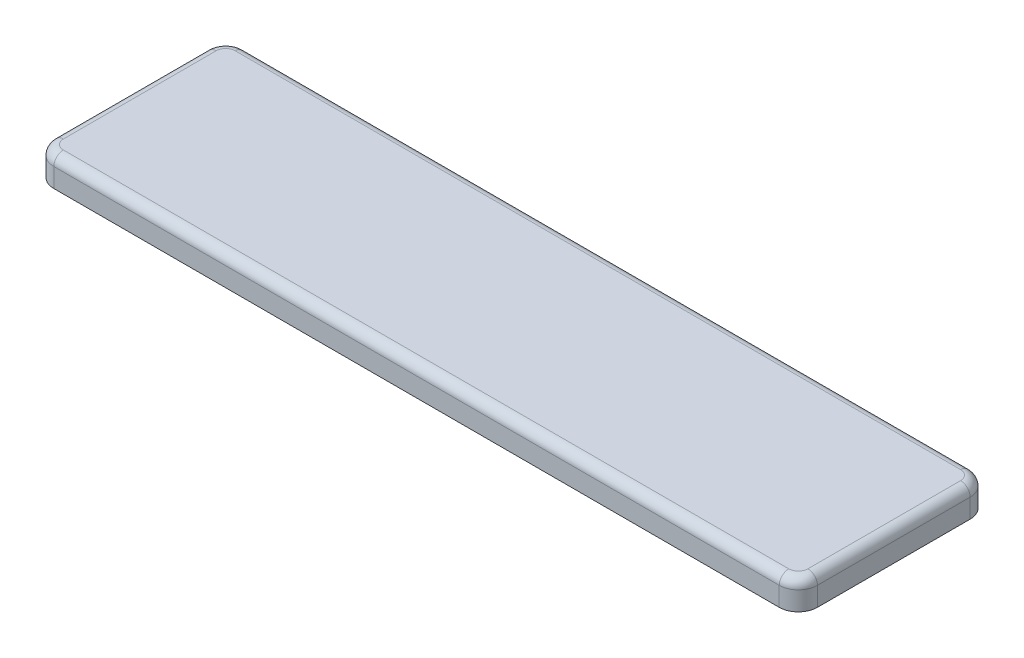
ISO-10303-21;
HEADER;
FILE_DESCRIPTION(('STEP AP214'),'2;1');
FILE_NAME('part.step','',(''),(''),'','','');
FILE_SCHEMA(('AUTOMOTIVE_DESIGN { 1 0 10303 214 1 1 1 1 }'));
ENDSEC;
DATA;
#1=APPLICATION_CONTEXT('core data for automotive mechanical design processes');
#2=APPLICATION_PROTOCOL_DEFINITION('international standard','automotive_design',2000,#1);
#3=PRODUCT_CONTEXT('',#1,'mechanical');
#4=PRODUCT('Part','Part','',(#3));
#5=PRODUCT_RELATED_PRODUCT_CATEGORY('part','',(#4));
#6=PRODUCT_DEFINITION_FORMATION('','',#4);
#7=PRODUCT_DEFINITION_CONTEXT('part definition',#1,'design');
#8=PRODUCT_DEFINITION('design','',#6,#7);
#9=PRODUCT_DEFINITION_SHAPE('','',#8);
#10=(LENGTH_UNIT() NAMED_UNIT(*) SI_UNIT(.MILLI.,.METRE.));
#11=(NAMED_UNIT(*) PLANE_ANGLE_UNIT() SI_UNIT($,.RADIAN.));
#12=(NAMED_UNIT(*) SI_UNIT($,.STERADIAN.) SOLID_ANGLE_UNIT());
#13=UNCERTAINTY_MEASURE_WITH_UNIT(LENGTH_MEASURE(1.E-05),#10,'distance_accuracy_value','');
#14=(GEOMETRIC_REPRESENTATION_CONTEXT(3) GLOBAL_UNCERTAINTY_ASSIGNED_CONTEXT((#13)) GLOBAL_UNIT_ASSIGNED_CONTEXT((#10,
#11,#12)) REPRESENTATION_CONTEXT('',''));
#15=CARTESIAN_POINT('',(0.,0.,0.));
#16=DIRECTION('',(0.,0.,1.));
#17=DIRECTION('',(1.,0.,0.));
#18=AXIS2_PLACEMENT_3D('',#15,#16,#17);
#19=CARTESIAN_POINT('',(-38.,-0.5,8.));
#20=DIRECTION('',(0.,-1.,0.));
#21=DIRECTION('',(0.,0.,-1.));
#22=AXIS2_PLACEMENT_3D('',#19,#20,#21);
#23=PLANE('',#22);
#24=DIRECTION('',(1.,0.,0.));
#25=VECTOR('',#24,1.);
#26=CARTESIAN_POINT('',(8.65000000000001,-0.5,-2.1));
#27=LINE('',#26,#25);
#28=CARTESIAN_POINT('',(8.65000000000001,-0.5,-2.1));
#29=VERTEX_POINT('',#28);
#30=CARTESIAN_POINT('',(11.35,-0.5,-2.1));
#31=VERTEX_POINT('',#30);
#32=EDGE_CURVE('E356',#29,#31,#27,.T.);
#33=ORIENTED_EDGE('',*,*,#32,.F.);
#34=DIRECTION('',(0.,0.,-1.));
#35=VECTOR('',#34,1.);
#36=CARTESIAN_POINT('',(8.65000000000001,-0.5,2.1));
#37=LINE('',#36,#35);
#38=CARTESIAN_POINT('',(8.65000000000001,-0.5,2.1));
#39=VERTEX_POINT('',#38);
#40=EDGE_CURVE('E330',#39,#29,#37,.T.);
#41=ORIENTED_EDGE('',*,*,#40,.F.);
#42=DIRECTION('',(-1.,0.,0.));
#43=VECTOR('',#42,1.);
#44=CARTESIAN_POINT('',(8.65000000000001,-0.5,2.1));
#45=LINE('',#44,#43);
#46=CARTESIAN_POINT('',(11.35,-0.5,2.1));
#47=VERTEX_POINT('',#46);
#48=EDGE_CURVE('E362',#47,#39,#45,.T.);
#49=ORIENTED_EDGE('',*,*,#48,.F.);
#50=DIRECTION('',(0.,0.,1.));
#51=VECTOR('',#50,1.);
#52=CARTESIAN_POINT('',(11.35,-0.5,2.1));
#53=LINE('',#52,#51);
#54=EDGE_CURVE('E359',#31,#47,#53,.T.);
#55=ORIENTED_EDGE('',*,*,#54,.F.);
#56=EDGE_LOOP('',(#33,#41,#49,#55));
#57=FACE_BOUND('',#56,.T.);
#58=DIRECTION('',(1.,0.,0.));
#59=VECTOR('',#58,1.);
#60=CARTESIAN_POINT('',(-31.35,-0.5,-2.1));
#61=LINE('',#60,#59);
#62=CARTESIAN_POINT('',(-31.35,-0.5,-2.1));
#63=VERTEX_POINT('',#62);
#64=CARTESIAN_POINT('',(-28.65,-0.5,-2.1));
#65=VERTEX_POINT('',#64);
#66=EDGE_CURVE('E396',#63,#65,#61,.T.);
#67=ORIENTED_EDGE('',*,*,#66,.F.);
#68=DIRECTION('',(0.,0.,-1.));
#69=VECTOR('',#68,1.);
#70=CARTESIAN_POINT('',(-31.35,-0.5,2.1));
#71=LINE('',#70,#69);
#72=CARTESIAN_POINT('',(-31.35,-0.5,2.1));
#73=VERTEX_POINT('',#72);
#74=EDGE_CURVE('E393',#73,#63,#71,.T.);
#75=ORIENTED_EDGE('',*,*,#74,.F.);
#76=DIRECTION('',(-1.,0.,0.));
#77=VECTOR('',#76,1.);
#78=CARTESIAN_POINT('',(-31.35,-0.5,2.1));
#79=LINE('',#78,#77);
#80=CARTESIAN_POINT('',(-28.65,-0.5,2.1));
#81=VERTEX_POINT('',#80);
#82=EDGE_CURVE('E402',#81,#73,#79,.T.);
#83=ORIENTED_EDGE('',*,*,#82,.F.);
#84=DIRECTION('',(0.,0.,1.));
#85=VECTOR('',#84,1.);
#86=CARTESIAN_POINT('',(-28.65,-0.5,2.1));
#87=LINE('',#86,#85);
#88=EDGE_CURVE('E399',#65,#81,#87,.T.);
#89=ORIENTED_EDGE('',*,*,#88,.F.);
#90=EDGE_LOOP('',(#67,#75,#83,#89));
#91=FACE_BOUND('',#90,.T.);
#92=CARTESIAN_POINT('',(-38.,-0.5,8.));
#93=DIRECTION('',(0.,-1.,0.));
#94=DIRECTION('',(0.,0.,-1.));
#95=AXIS2_PLACEMENT_3D('',#92,#93,#94);
#96=CIRCLE('',#95,0.800000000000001);
#97=CARTESIAN_POINT('',(-38.,-0.5,8.8));
#98=VERTEX_POINT('',#97);
#99=CARTESIAN_POINT('',(-38.8,-0.5,8.));
#100=VERTEX_POINT('',#99);
#101=EDGE_CURVE('E414',#98,#100,#96,.T.);
#102=ORIENTED_EDGE('',*,*,#101,.T.);
#103=DIRECTION('',(0.,0.,-1.));
#104=VECTOR('',#103,1.);
#105=CARTESIAN_POINT('',(-38.8,-0.5,8.));
#106=LINE('',#105,#104);
#107=CARTESIAN_POINT('',(-38.8,-0.5,-8.));
#108=VERTEX_POINT('',#107);
#109=EDGE_CURVE('E417',#100,#108,#106,.T.);
#110=ORIENTED_EDGE('',*,*,#109,.T.);
#111=CARTESIAN_POINT('',(-38.,-0.5,-8.));
#112=DIRECTION('',(0.,-1.,0.));
#113=DIRECTION('',(0.,0.,-1.));
#114=AXIS2_PLACEMENT_3D('',#111,#112,#113);
#115=CIRCLE('',#114,0.8);
#116=CARTESIAN_POINT('',(-38.,-0.5,-8.8));
#117=VERTEX_POINT('',#116);
#118=EDGE_CURVE('E421',#108,#117,#115,.T.);
#119=ORIENTED_EDGE('',*,*,#118,.T.);
#120=DIRECTION('',(1.,0.,0.));
#121=VECTOR('',#120,1.);
#122=CARTESIAN_POINT('',(-38.,-0.5,-8.8));
#123=LINE('',#122,#121);
#124=CARTESIAN_POINT('',(38.,-0.5,-8.8));
#125=VERTEX_POINT('',#124);
#126=EDGE_CURVE('E424',#117,#125,#123,.T.);
#127=ORIENTED_EDGE('',*,*,#126,.T.);
#128=CARTESIAN_POINT('',(38.,-0.5,-8.));
#129=DIRECTION('',(0.,-1.,0.));
#130=DIRECTION('',(0.,0.,-1.));
#131=AXIS2_PLACEMENT_3D('',#128,#129,#130);
#132=CIRCLE('',#131,0.799999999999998);
#133=CARTESIAN_POINT('',(38.8,-0.5,-8.));
#134=VERTEX_POINT('',#133);
#135=EDGE_CURVE('E427',#125,#134,#132,.T.);
#136=ORIENTED_EDGE('',*,*,#135,.T.);
#137=DIRECTION('',(0.,0.,1.));
#138=VECTOR('',#137,1.);
#139=CARTESIAN_POINT('',(38.8,-0.5,8.));
#140=LINE('',#139,#138);
#141=CARTESIAN_POINT('',(38.8,-0.5,8.));
#142=VERTEX_POINT('',#141);
#143=EDGE_CURVE('E430',#134,#142,#140,.T.);
#144=ORIENTED_EDGE('',*,*,#143,.T.);
#145=CARTESIAN_POINT('',(38.,-0.5,8.));
#146=DIRECTION('',(0.,-1.,0.));
#147=DIRECTION('',(0.,0.,-1.));
#148=AXIS2_PLACEMENT_3D('',#145,#146,#147);
#149=CIRCLE('',#148,0.799999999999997);
#150=CARTESIAN_POINT('',(38.,-0.5,8.8));
#151=VERTEX_POINT('',#150);
#152=EDGE_CURVE('E433',#142,#151,#149,.T.);
#153=ORIENTED_EDGE('',*,*,#152,.T.);
#154=DIRECTION('',(-1.,0.,0.));
#155=VECTOR('',#154,1.);
#156=CARTESIAN_POINT('',(-38.,-0.5,8.8));
#157=LINE('',#156,#155);
#158=EDGE_CURVE('E436',#151,#98,#157,.T.);
#159=ORIENTED_EDGE('',*,*,#158,.T.);
#160=EDGE_LOOP('',(#102,#110,#119,#127,#136,#144,#153,#159));
#161=FACE_BOUND('',#160,.T.);
#162=DIRECTION('',(1.,0.,0.));
#163=VECTOR('',#162,1.);
#164=CARTESIAN_POINT('',(-11.35,-0.5,-2.1));
#165=LINE('',#164,#163);
#166=CARTESIAN_POINT('',(-11.35,-0.5,-2.1));
#167=VERTEX_POINT('',#166);
#168=CARTESIAN_POINT('',(-8.65,-0.5,-2.1));
#169=VERTEX_POINT('',#168);
#170=EDGE_CURVE('E376',#167,#169,#165,.T.);
#171=ORIENTED_EDGE('',*,*,#170,.F.);
#172=DIRECTION('',(0.,0.,-1.));
#173=VECTOR('',#172,1.);
#174=CARTESIAN_POINT('',(-11.35,-0.5,2.1));
#175=LINE('',#174,#173);
#176=CARTESIAN_POINT('',(-11.35,-0.5,2.1));
#177=VERTEX_POINT('',#176);
#178=EDGE_CURVE('E373',#177,#167,#175,.T.);
#179=ORIENTED_EDGE('',*,*,#178,.F.);
#180=DIRECTION('',(-1.,0.,0.));
#181=VECTOR('',#180,1.);
#182=CARTESIAN_POINT('',(-11.35,-0.5,2.1));
#183=LINE('',#182,#181);
#184=CARTESIAN_POINT('',(-8.65,-0.5,2.1));
#185=VERTEX_POINT('',#184);
#186=EDGE_CURVE('E382',#185,#177,#183,.T.);
#187=ORIENTED_EDGE('',*,*,#186,.F.);
#188=DIRECTION('',(0.,0.,1.));
#189=VECTOR('',#188,1.);
#190=CARTESIAN_POINT('',(-8.65,-0.5,2.1));
#191=LINE('',#190,#189);
#192=EDGE_CURVE('E379',#169,#185,#191,.T.);
#193=ORIENTED_EDGE('',*,*,#192,.F.);
#194=EDGE_LOOP('',(#171,#179,#187,#193));
#195=FACE_BOUND('',#194,.T.);
#196=DIRECTION('',(1.,0.,0.));
#197=VECTOR('',#196,1.);
#198=CARTESIAN_POINT('',(28.65,-0.5,-2.1));
#199=LINE('',#198,#197);
#200=CARTESIAN_POINT('',(28.65,-0.5,-2.1));
#201=VERTEX_POINT('',#200);
#202=CARTESIAN_POINT('',(31.35,-0.5,-2.1));
#203=VERTEX_POINT('',#202);
#204=EDGE_CURVE('E324',#201,#203,#199,.T.);
#205=ORIENTED_EDGE('',*,*,#204,.F.);
#206=DIRECTION('',(0.,0.,-1.));
#207=VECTOR('',#206,1.);
#208=CARTESIAN_POINT('',(28.65,-0.5,2.1));
#209=LINE('',#208,#207);
#210=CARTESIAN_POINT('',(28.65,-0.5,2.1));
#211=VERTEX_POINT('',#210);
#212=EDGE_CURVE('E334',#211,#201,#209,.T.);
#213=ORIENTED_EDGE('',*,*,#212,.F.);
#214=DIRECTION('',(-1.,0.,0.));
#215=VECTOR('',#214,1.);
#216=CARTESIAN_POINT('',(28.65,-0.5,2.1));
#217=LINE('',#216,#215);
#218=CARTESIAN_POINT('',(31.35,-0.5,2.1));
#219=VERTEX_POINT('',#218);
#220=EDGE_CURVE('E346',#219,#211,#217,.T.);
#221=ORIENTED_EDGE('',*,*,#220,.F.);
#222=DIRECTION('',(0.,0.,1.));
#223=VECTOR('',#222,1.);
#224=CARTESIAN_POINT('',(31.35,-0.5,2.1));
#225=LINE('',#224,#223);
#226=EDGE_CURVE('E344',#203,#219,#225,.T.);
#227=ORIENTED_EDGE('',*,*,#226,.F.);
#228=EDGE_LOOP('',(#205,#213,#221,#227));
#229=FACE_BOUND('',#228,.T.);
#230=ADVANCED_FACE('F37',(#57,#91,#161,#195,#229),#23,.T.);
#231=CARTESIAN_POINT('',(-38.,1.5,-8.));
#232=DIRECTION('',(0.,-1.,0.));
#233=DIRECTION('',(0.,0.,-1.));
#234=AXIS2_PLACEMENT_3D('',#231,#232,#233);
#235=CYLINDRICAL_SURFACE('',#234,2.);
#236=DIRECTION('',(0.,-1.,0.));
#237=VECTOR('',#236,1.);
#238=CARTESIAN_POINT('',(-40.,1.5,-8.));
#239=LINE('',#238,#237);
#240=CARTESIAN_POINT('',(-40.,0.5,-8.));
#241=VERTEX_POINT('',#240);
#242=CARTESIAN_POINT('',(-40.,-1.5,-8.));
#243=VERTEX_POINT('',#242);
#244=EDGE_CURVE('E517',#241,#243,#239,.T.);
#245=ORIENTED_EDGE('',*,*,#244,.F.);
#246=CARTESIAN_POINT('',(-38.,0.5,-8.));
#247=DIRECTION('',(0.,1.,0.));
#248=DIRECTION('',(0.,0.,1.));
#249=AXIS2_PLACEMENT_3D('',#246,#247,#248);
#250=CIRCLE('',#249,2.);
#251=CARTESIAN_POINT('',(-38.,0.5,-10.));
#252=VERTEX_POINT('',#251);
#253=EDGE_CURVE('E541',#241,#252,#250,.F.);
#254=ORIENTED_EDGE('',*,*,#253,.T.);
#255=DIRECTION('',(0.,-1.,0.));
#256=VECTOR('',#255,1.);
#257=CARTESIAN_POINT('',(-38.,1.5,-10.));
#258=LINE('',#257,#256);
#259=CARTESIAN_POINT('',(-38.,-1.5,-10.));
#260=VERTEX_POINT('',#259);
#261=EDGE_CURVE('E503',#252,#260,#258,.T.);
#262=ORIENTED_EDGE('',*,*,#261,.T.);
#263=CARTESIAN_POINT('',(-38.,-1.5,-8.));
#264=DIRECTION('',(0.,1.,0.));
#265=DIRECTION('',(0.,0.,1.));
#266=AXIS2_PLACEMENT_3D('',#263,#264,#265);
#267=CIRCLE('',#266,2.);
#268=EDGE_CURVE('E478',#260,#243,#267,.T.);
#269=ORIENTED_EDGE('',*,*,#268,.T.);
#270=EDGE_LOOP('',(#245,#254,#262,#269));
#271=FACE_BOUND('',#270,.T.);
#272=ADVANCED_FACE('F714',(#271),#235,.T.);
#273=CARTESIAN_POINT('',(-40.,1.5,8.));
#274=DIRECTION('',(1.,0.,0.));
#275=DIRECTION('',(0.,0.,-1.));
#276=AXIS2_PLACEMENT_3D('',#273,#274,#275);
#277=PLANE('',#276);
#278=DIRECTION('',(0.,-1.,0.));
#279=VECTOR('',#278,1.);
#280=CARTESIAN_POINT('',(-40.,1.5,8.));
#281=LINE('',#280,#279);
#282=CARTESIAN_POINT('',(-40.,0.5,8.));
#283=VERTEX_POINT('',#282);
#284=CARTESIAN_POINT('',(-40.,-1.5,8.));
#285=VERTEX_POINT('',#284);
#286=EDGE_CURVE('E515',#283,#285,#281,.T.);
#287=ORIENTED_EDGE('',*,*,#286,.F.);
#288=DIRECTION('',(0.,0.,1.));
#289=VECTOR('',#288,1.);
#290=CARTESIAN_POINT('',(-40.,0.5,-8.));
#291=LINE('',#290,#289);
#292=EDGE_CURVE('E539',#283,#241,#291,.F.);
#293=ORIENTED_EDGE('',*,*,#292,.T.);
#294=ORIENTED_EDGE('',*,*,#244,.T.);
#295=DIRECTION('',(0.,0.,1.));
#296=VECTOR('',#295,1.);
#297=CARTESIAN_POINT('',(-40.,-1.5,8.));
#298=LINE('',#297,#296);
#299=EDGE_CURVE('E481',#243,#285,#298,.T.);
#300=ORIENTED_EDGE('',*,*,#299,.T.);
#301=EDGE_LOOP('',(#287,#293,#294,#300));
#302=FACE_BOUND('',#301,.T.);
#303=ADVANCED_FACE('F720',(#302),#277,.F.);
#304=CARTESIAN_POINT('',(-38.,1.5,8.));
#305=DIRECTION('',(0.,-1.,0.));
#306=DIRECTION('',(0.,0.,-1.));
#307=AXIS2_PLACEMENT_3D('',#304,#305,#306);
#308=CYLINDRICAL_SURFACE('',#307,2.);
#309=DIRECTION('',(0.,-1.,0.));
#310=VECTOR('',#309,1.);
#311=CARTESIAN_POINT('',(-38.,1.5,10.));
#312=LINE('',#311,#310);
#313=CARTESIAN_POINT('',(-38.,0.5,10.));
#314=VERTEX_POINT('',#313);
#315=CARTESIAN_POINT('',(-38.,-1.5,10.));
#316=VERTEX_POINT('',#315);
#317=EDGE_CURVE('E513',#314,#316,#312,.T.);
#318=ORIENTED_EDGE('',*,*,#317,.F.);
#319=CARTESIAN_POINT('',(-38.,0.5,8.));
#320=DIRECTION('',(0.,1.,0.));
#321=DIRECTION('',(0.,0.,1.));
#322=AXIS2_PLACEMENT_3D('',#319,#320,#321);
#323=CIRCLE('',#322,2.);
#324=EDGE_CURVE('E536',#314,#283,#323,.F.);
#325=ORIENTED_EDGE('',*,*,#324,.T.);
#326=ORIENTED_EDGE('',*,*,#286,.T.);
#327=CARTESIAN_POINT('',(-38.,-1.5,8.));
#328=DIRECTION('',(0.,1.,0.));
#329=DIRECTION('',(0.,0.,1.));
#330=AXIS2_PLACEMENT_3D('',#327,#328,#329);
#331=CIRCLE('',#330,2.);
#332=EDGE_CURVE('E485',#285,#316,#331,.T.);
#333=ORIENTED_EDGE('',*,*,#332,.T.);
#334=EDGE_LOOP('',(#318,#325,#326,#333));
#335=FACE_BOUND('',#334,.T.);
#336=ADVANCED_FACE('F789',(#335),#308,.T.);
#337=CARTESIAN_POINT('',(-38.,1.5,10.));
#338=DIRECTION('',(0.,0.,-1.));
#339=DIRECTION('',(-1.,0.,0.));
#340=AXIS2_PLACEMENT_3D('',#337,#338,#339);
#341=PLANE('',#340);
#342=DIRECTION('',(0.,-1.,0.));
#343=VECTOR('',#342,1.);
#344=CARTESIAN_POINT('',(38.,1.5,9.99999999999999));
#345=LINE('',#344,#343);
#346=CARTESIAN_POINT('',(38.,0.5,9.99999999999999));
#347=VERTEX_POINT('',#346);
#348=CARTESIAN_POINT('',(38.,-1.5,9.99999999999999));
#349=VERTEX_POINT('',#348);
#350=EDGE_CURVE('E511',#347,#349,#345,.T.);
#351=ORIENTED_EDGE('',*,*,#350,.F.);
#352=DIRECTION('',(1.,0.,0.));
#353=VECTOR('',#352,1.);
#354=CARTESIAN_POINT('',(-38.,0.5,10.));
#355=LINE('',#354,#353);
#356=EDGE_CURVE('E551',#347,#314,#355,.F.);
#357=ORIENTED_EDGE('',*,*,#356,.T.);
#358=ORIENTED_EDGE('',*,*,#317,.T.);
#359=DIRECTION('',(1.,0.,0.));
#360=VECTOR('',#359,1.);
#361=CARTESIAN_POINT('',(-38.,-1.5,10.));
#362=LINE('',#361,#360);
#363=EDGE_CURVE('E488',#316,#349,#362,.T.);
#364=ORIENTED_EDGE('',*,*,#363,.T.);
#365=EDGE_LOOP('',(#351,#357,#358,#364));
#366=FACE_BOUND('',#365,.T.);
#367=ADVANCED_FACE('F785',(#366),#341,.F.);
#368=CARTESIAN_POINT('',(38.,1.5,7.99999999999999));
#369=DIRECTION('',(0.,-1.,0.));
#370=DIRECTION('',(0.,0.,-1.));
#371=AXIS2_PLACEMENT_3D('',#368,#369,#370);
#372=CYLINDRICAL_SURFACE('',#371,2.);
#373=DIRECTION('',(0.,-1.,0.));
#374=VECTOR('',#373,1.);
#375=CARTESIAN_POINT('',(40.,1.5,7.99999999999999));
#376=LINE('',#375,#374);
#377=CARTESIAN_POINT('',(40.,0.5,7.99999999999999));
#378=VERTEX_POINT('',#377);
#379=CARTESIAN_POINT('',(40.,-1.5,7.99999999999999));
#380=VERTEX_POINT('',#379);
#381=EDGE_CURVE('E509',#378,#380,#376,.T.);
#382=ORIENTED_EDGE('',*,*,#381,.F.);
#383=CARTESIAN_POINT('',(38.,0.5,7.99999999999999));
#384=DIRECTION('',(0.,1.,0.));
#385=DIRECTION('',(0.,0.,1.));
#386=AXIS2_PLACEMENT_3D('',#383,#384,#385);
#387=CIRCLE('',#386,2.);
#388=EDGE_CURVE('E549',#378,#347,#387,.F.);
#389=ORIENTED_EDGE('',*,*,#388,.T.);
#390=ORIENTED_EDGE('',*,*,#350,.T.);
#391=CARTESIAN_POINT('',(38.,-1.5,7.99999999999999));
#392=DIRECTION('',(0.,1.,0.));
#393=DIRECTION('',(0.,0.,1.));
#394=AXIS2_PLACEMENT_3D('',#391,#392,#393);
#395=CIRCLE('',#394,2.);
#396=EDGE_CURVE('E491',#349,#380,#395,.T.);
#397=ORIENTED_EDGE('',*,*,#396,.T.);
#398=EDGE_LOOP('',(#382,#389,#390,#397));
#399=FACE_BOUND('',#398,.T.);
#400=ADVANCED_FACE('F781',(#399),#372,.T.);
#401=CARTESIAN_POINT('',(40.,1.5,7.99999999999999));
#402=DIRECTION('',(-1.,0.,0.));
#403=DIRECTION('',(0.,0.,1.));
#404=AXIS2_PLACEMENT_3D('',#401,#402,#403);
#405=PLANE('',#404);
#406=DIRECTION('',(0.,-1.,0.));
#407=VECTOR('',#406,1.);
#408=CARTESIAN_POINT('',(40.,1.5,-8.00000000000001));
#409=LINE('',#408,#407);
#410=CARTESIAN_POINT('',(40.,0.5,-8.00000000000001));
#411=VERTEX_POINT('',#410);
#412=CARTESIAN_POINT('',(40.,-1.5,-8.00000000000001));
#413=VERTEX_POINT('',#412);
#414=EDGE_CURVE('E507',#411,#413,#409,.T.);
#415=ORIENTED_EDGE('',*,*,#414,.F.);
#416=DIRECTION('',(0.,0.,-1.));
#417=VECTOR('',#416,1.);
#418=CARTESIAN_POINT('',(40.,0.5,7.99999999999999));
#419=LINE('',#418,#417);
#420=EDGE_CURVE('E547',#411,#378,#419,.F.);
#421=ORIENTED_EDGE('',*,*,#420,.T.);
#422=ORIENTED_EDGE('',*,*,#381,.T.);
#423=DIRECTION('',(0.,0.,-1.));
#424=VECTOR('',#423,1.);
#425=CARTESIAN_POINT('',(40.,-1.5,7.99999999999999));
#426=LINE('',#425,#424);
#427=EDGE_CURVE('E494',#380,#413,#426,.T.);
#428=ORIENTED_EDGE('',*,*,#427,.T.);
#429=EDGE_LOOP('',(#415,#421,#422,#428));
#430=FACE_BOUND('',#429,.T.);
#431=ADVANCED_FACE('F777',(#430),#405,.F.);
#432=CARTESIAN_POINT('',(38.,1.5,-8.00000000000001));
#433=DIRECTION('',(0.,-1.,0.));
#434=DIRECTION('',(0.,0.,-1.));
#435=AXIS2_PLACEMENT_3D('',#432,#433,#434);
#436=CYLINDRICAL_SURFACE('',#435,2.);
#437=DIRECTION('',(0.,-1.,0.));
#438=VECTOR('',#437,1.);
#439=CARTESIAN_POINT('',(38.,1.5,-10.));
#440=LINE('',#439,#438);
#441=CARTESIAN_POINT('',(38.,0.5,-10.));
#442=VERTEX_POINT('',#441);
#443=CARTESIAN_POINT('',(38.,-1.5,-10.));
#444=VERTEX_POINT('',#443);
#445=EDGE_CURVE('E505',#442,#444,#440,.T.);
#446=ORIENTED_EDGE('',*,*,#445,.F.);
#447=CARTESIAN_POINT('',(38.,0.5,-8.00000000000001));
#448=DIRECTION('',(0.,1.,0.));
#449=DIRECTION('',(0.,0.,1.));
#450=AXIS2_PLACEMENT_3D('',#447,#448,#449);
#451=CIRCLE('',#450,2.);
#452=EDGE_CURVE('E545',#442,#411,#451,.F.);
#453=ORIENTED_EDGE('',*,*,#452,.T.);
#454=ORIENTED_EDGE('',*,*,#414,.T.);
#455=CARTESIAN_POINT('',(38.,-1.5,-8.00000000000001));
#456=DIRECTION('',(0.,1.,0.));
#457=DIRECTION('',(0.,0.,1.));
#458=AXIS2_PLACEMENT_3D('',#455,#456,#457);
#459=CIRCLE('',#458,2.);
#460=EDGE_CURVE('E497',#413,#444,#459,.T.);
#461=ORIENTED_EDGE('',*,*,#460,.T.);
#462=EDGE_LOOP('',(#446,#453,#454,#461));
#463=FACE_BOUND('',#462,.T.);
#464=ADVANCED_FACE('F773',(#463),#436,.T.);
#465=CARTESIAN_POINT('',(-38.,1.5,-10.));
#466=DIRECTION('',(0.,0.,1.));
#467=DIRECTION('',(1.,0.,0.));
#468=AXIS2_PLACEMENT_3D('',#465,#466,#467);
#469=PLANE('',#468);
#470=ORIENTED_EDGE('',*,*,#261,.F.);
#471=DIRECTION('',(-1.,0.,0.));
#472=VECTOR('',#471,1.);
#473=CARTESIAN_POINT('',(38.,0.5,-10.));
#474=LINE('',#473,#472);
#475=EDGE_CURVE('E543',#252,#442,#474,.F.);
#476=ORIENTED_EDGE('',*,*,#475,.T.);
#477=ORIENTED_EDGE('',*,*,#445,.T.);
#478=DIRECTION('',(-1.,0.,0.));
#479=VECTOR('',#478,1.);
#480=CARTESIAN_POINT('',(-38.,-1.5,-10.));
#481=LINE('',#480,#479);
#482=EDGE_CURVE('E500',#444,#260,#481,.T.);
#483=ORIENTED_EDGE('',*,*,#482,.T.);
#484=EDGE_LOOP('',(#470,#476,#477,#483));
#485=FACE_BOUND('',#484,.T.);
#486=ADVANCED_FACE('F765',(#485),#469,.F.);
#487=CARTESIAN_POINT('',(-38.,1.5,-8.));
#488=DIRECTION('',(0.,1.,0.));
#489=DIRECTION('',(0.,0.,1.));
#490=AXIS2_PLACEMENT_3D('',#487,#488,#489);
#491=PLANE('',#490);
#492=DIRECTION('',(0.,0.,1.));
#493=VECTOR('',#492,1.);
#494=CARTESIAN_POINT('',(-39.,1.5,8.));
#495=LINE('',#494,#493);
#496=CARTESIAN_POINT('',(-39.,1.5,-8.));
#497=VERTEX_POINT('',#496);
#498=CARTESIAN_POINT('',(-39.,1.5,8.));
#499=VERTEX_POINT('',#498);
#500=EDGE_CURVE('E531',#497,#499,#495,.T.);
#501=ORIENTED_EDGE('',*,*,#500,.T.);
#502=CARTESIAN_POINT('',(-38.,1.5,8.));
#503=DIRECTION('',(0.,1.,0.));
#504=DIRECTION('',(0.,0.,1.));
#505=AXIS2_PLACEMENT_3D('',#502,#503,#504);
#506=CIRCLE('',#505,1.);
#507=CARTESIAN_POINT('',(-38.,1.5,9.));
#508=VERTEX_POINT('',#507);
#509=EDGE_CURVE('E533',#499,#508,#506,.T.);
#510=ORIENTED_EDGE('',*,*,#509,.T.);
#511=DIRECTION('',(1.,0.,0.));
#512=VECTOR('',#511,1.);
#513=CARTESIAN_POINT('',(38.,1.5,9.));
#514=LINE('',#513,#512);
#515=CARTESIAN_POINT('',(38.,1.5,9.));
#516=VERTEX_POINT('',#515);
#517=EDGE_CURVE('E519',#508,#516,#514,.T.);
#518=ORIENTED_EDGE('',*,*,#517,.T.);
#519=CARTESIAN_POINT('',(38.,1.5,7.99999999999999));
#520=DIRECTION('',(0.,1.,0.));
#521=DIRECTION('',(0.,0.,1.));
#522=AXIS2_PLACEMENT_3D('',#519,#520,#521);
#523=CIRCLE('',#522,1.);
#524=CARTESIAN_POINT('',(39.,1.5,7.99999999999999));
#525=VERTEX_POINT('',#524);
#526=EDGE_CURVE('E521',#516,#525,#523,.T.);
#527=ORIENTED_EDGE('',*,*,#526,.T.);
#528=DIRECTION('',(0.,0.,-1.));
#529=VECTOR('',#528,1.);
#530=CARTESIAN_POINT('',(39.,1.5,-8.00000000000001));
#531=LINE('',#530,#529);
#532=CARTESIAN_POINT('',(39.,1.5,-8.00000000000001));
#533=VERTEX_POINT('',#532);
#534=EDGE_CURVE('E523',#525,#533,#531,.T.);
#535=ORIENTED_EDGE('',*,*,#534,.T.);
#536=CARTESIAN_POINT('',(38.,1.5,-8.00000000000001));
#537=DIRECTION('',(0.,1.,0.));
#538=DIRECTION('',(0.,0.,1.));
#539=AXIS2_PLACEMENT_3D('',#536,#537,#538);
#540=CIRCLE('',#539,1.);
#541=CARTESIAN_POINT('',(38.,1.5,-9.00000000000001));
#542=VERTEX_POINT('',#541);
#543=EDGE_CURVE('E525',#533,#542,#540,.T.);
#544=ORIENTED_EDGE('',*,*,#543,.T.);
#545=DIRECTION('',(-1.,0.,0.));
#546=VECTOR('',#545,1.);
#547=CARTESIAN_POINT('',(-38.,1.5,-9.));
#548=LINE('',#547,#546);
#549=CARTESIAN_POINT('',(-38.,1.5,-9.));
#550=VERTEX_POINT('',#549);
#551=EDGE_CURVE('E527',#542,#550,#548,.T.);
#552=ORIENTED_EDGE('',*,*,#551,.T.);
#553=CARTESIAN_POINT('',(-38.,1.5,-8.));
#554=DIRECTION('',(0.,1.,0.));
#555=DIRECTION('',(0.,0.,1.));
#556=AXIS2_PLACEMENT_3D('',#553,#554,#555);
#557=CIRCLE('',#556,0.999999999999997);
#558=EDGE_CURVE('E529',#550,#497,#557,.T.);
#559=ORIENTED_EDGE('',*,*,#558,.T.);
#560=EDGE_LOOP('',(#501,#510,#518,#527,#535,#544,#552,#559));
#561=FACE_BOUND('',#560,.T.);
#562=ADVANCED_FACE('F761',(#561),#491,.T.);
#563=CARTESIAN_POINT('',(-38.,-1.5,-8.));
#564=DIRECTION('',(0.,1.,0.));
#565=DIRECTION('',(0.,0.,1.));
#566=AXIS2_PLACEMENT_3D('',#563,#564,#565);
#567=PLANE('',#566);
#568=DIRECTION('',(0.,0.,-1.));
#569=VECTOR('',#568,1.);
#570=CARTESIAN_POINT('',(-38.8,-1.5,8.));
#571=LINE('',#570,#569);
#572=CARTESIAN_POINT('',(-38.8,-1.5,8.));
#573=VERTEX_POINT('',#572);
#574=CARTESIAN_POINT('',(-38.8,-1.5,-8.));
#575=VERTEX_POINT('',#574);
#576=EDGE_CURVE('E441',#573,#575,#571,.T.);
#577=ORIENTED_EDGE('',*,*,#576,.F.);
#578=CARTESIAN_POINT('',(-38.,-1.5,8.));
#579=DIRECTION('',(0.,-1.,0.));
#580=DIRECTION('',(0.,0.,-1.));
#581=AXIS2_PLACEMENT_3D('',#578,#579,#580);
#582=CIRCLE('',#581,0.800000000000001);
#583=CARTESIAN_POINT('',(-38.,-1.5,8.8));
#584=VERTEX_POINT('',#583);
#585=EDGE_CURVE('E413',#584,#573,#582,.T.);
#586=ORIENTED_EDGE('',*,*,#585,.F.);
#587=DIRECTION('',(-1.,0.,0.));
#588=VECTOR('',#587,1.);
#589=CARTESIAN_POINT('',(-38.,-1.5,8.8));
#590=LINE('',#589,#588);
#591=CARTESIAN_POINT('',(38.,-1.5,8.8));
#592=VERTEX_POINT('',#591);
#593=EDGE_CURVE('E418',#592,#584,#590,.T.);
#594=ORIENTED_EDGE('',*,*,#593,.F.);
#595=CARTESIAN_POINT('',(38.,-1.5,8.));
#596=DIRECTION('',(0.,-1.,0.));
#597=DIRECTION('',(0.,0.,-1.));
#598=AXIS2_PLACEMENT_3D('',#595,#596,#597);
#599=CIRCLE('',#598,0.799999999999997);
#600=CARTESIAN_POINT('',(38.8,-1.5,8.));
#601=VERTEX_POINT('',#600);
#602=EDGE_CURVE('E456',#601,#592,#599,.T.);
#603=ORIENTED_EDGE('',*,*,#602,.F.);
#604=DIRECTION('',(0.,0.,1.));
#605=VECTOR('',#604,1.);
#606=CARTESIAN_POINT('',(38.8,-1.5,8.));
#607=LINE('',#606,#605);
#608=CARTESIAN_POINT('',(38.8,-1.5,-8.));
#609=VERTEX_POINT('',#608);
#610=EDGE_CURVE('E453',#609,#601,#607,.T.);
#611=ORIENTED_EDGE('',*,*,#610,.F.);
#612=CARTESIAN_POINT('',(38.,-1.5,-8.));
#613=DIRECTION('',(0.,-1.,0.));
#614=DIRECTION('',(0.,0.,-1.));
#615=AXIS2_PLACEMENT_3D('',#612,#613,#614);
#616=CIRCLE('',#615,0.799999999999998);
#617=CARTESIAN_POINT('',(38.,-1.5,-8.8));
#618=VERTEX_POINT('',#617);
#619=EDGE_CURVE('E450',#618,#609,#616,.T.);
#620=ORIENTED_EDGE('',*,*,#619,.F.);
#621=DIRECTION('',(1.,0.,0.));
#622=VECTOR('',#621,1.);
#623=CARTESIAN_POINT('',(-38.,-1.5,-8.8));
#624=LINE('',#623,#622);
#625=CARTESIAN_POINT('',(-38.,-1.5,-8.8));
#626=VERTEX_POINT('',#625);
#627=EDGE_CURVE('E447',#626,#618,#624,.T.);
#628=ORIENTED_EDGE('',*,*,#627,.F.);
#629=CARTESIAN_POINT('',(-38.,-1.5,-8.));
#630=DIRECTION('',(0.,-1.,0.));
#631=DIRECTION('',(0.,0.,-1.));
#632=AXIS2_PLACEMENT_3D('',#629,#630,#631);
#633=CIRCLE('',#632,0.8);
#634=EDGE_CURVE('E444',#575,#626,#633,.T.);
#635=ORIENTED_EDGE('',*,*,#634,.F.);
#636=EDGE_LOOP('',(#577,#586,#594,#603,#611,#620,#628,#635));
#637=FACE_BOUND('',#636,.T.);
#638=ORIENTED_EDGE('',*,*,#268,.F.);
#639=ORIENTED_EDGE('',*,*,#482,.F.);
#640=ORIENTED_EDGE('',*,*,#460,.F.);
#641=ORIENTED_EDGE('',*,*,#427,.F.);
#642=ORIENTED_EDGE('',*,*,#396,.F.);
#643=ORIENTED_EDGE('',*,*,#363,.F.);
#644=ORIENTED_EDGE('',*,*,#332,.F.);
#645=ORIENTED_EDGE('',*,*,#299,.F.);
#646=EDGE_LOOP('',(#638,#639,#640,#641,#642,#643,#644,#645));
#647=FACE_BOUND('',#646,.T.);
#648=ADVANCED_FACE('F764',(#637,#647),#567,.F.);
#649=CARTESIAN_POINT('',(38.,0.5,-8.00000000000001));
#650=DIRECTION('',(0.,1.,0.));
#651=DIRECTION('',(0.,0.,1.));
#652=AXIS2_PLACEMENT_3D('',#649,#650,#651);
#653=TOROIDAL_SURFACE('',#652,1.,1.);
#654=CARTESIAN_POINT('',(39.,0.5,-8.00000000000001));
#655=DIRECTION('',(0.,0.,1.));
#656=DIRECTION('',(1.,0.,0.));
#657=AXIS2_PLACEMENT_3D('',#654,#655,#656);
#658=CIRCLE('',#657,1.);
#659=EDGE_CURVE('E569',#411,#533,#658,.T.);
#660=ORIENTED_EDGE('',*,*,#659,.F.);
#661=ORIENTED_EDGE('',*,*,#452,.F.);
#662=CARTESIAN_POINT('',(38.,0.5,-9.00000000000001));
#663=DIRECTION('',(-1.,0.,0.));
#664=DIRECTION('',(0.,0.,1.));
#665=AXIS2_PLACEMENT_3D('',#662,#663,#664);
#666=CIRCLE('',#665,1.);
#667=EDGE_CURVE('E482',#542,#442,#666,.T.);
#668=ORIENTED_EDGE('',*,*,#667,.F.);
#669=ORIENTED_EDGE('',*,*,#543,.F.);
#670=EDGE_LOOP('',(#660,#661,#668,#669));
#671=FACE_BOUND('',#670,.T.);
#672=ADVANCED_FACE('F769',(#671),#653,.T.);
#673=CARTESIAN_POINT('',(-38.,0.5,-9.));
#674=DIRECTION('',(1.,0.,0.));
#675=DIRECTION('',(0.,0.,-1.));
#676=AXIS2_PLACEMENT_3D('',#673,#674,#675);
#677=CYLINDRICAL_SURFACE('',#676,1.);
#678=ORIENTED_EDGE('',*,*,#667,.T.);
#679=ORIENTED_EDGE('',*,*,#475,.F.);
#680=CARTESIAN_POINT('',(-38.,0.5,-9.));
#681=DIRECTION('',(-1.,0.,0.));
#682=DIRECTION('',(0.,0.,1.));
#683=AXIS2_PLACEMENT_3D('',#680,#681,#682);
#684=CIRCLE('',#683,1.);
#685=EDGE_CURVE('E566',#550,#252,#684,.T.);
#686=ORIENTED_EDGE('',*,*,#685,.F.);
#687=ORIENTED_EDGE('',*,*,#551,.F.);
#688=EDGE_LOOP('',(#678,#679,#686,#687));
#689=FACE_BOUND('',#688,.T.);
#690=ADVANCED_FACE('F819',(#689),#677,.T.);
#691=CARTESIAN_POINT('',(39.,0.5,-8.));
#692=DIRECTION('',(0.,0.,1.));
#693=DIRECTION('',(1.,0.,0.));
#694=AXIS2_PLACEMENT_3D('',#691,#692,#693);
#695=CYLINDRICAL_SURFACE('',#694,1.);
#696=ORIENTED_EDGE('',*,*,#659,.T.);
#697=ORIENTED_EDGE('',*,*,#534,.F.);
#698=CARTESIAN_POINT('',(39.,0.5,7.99999999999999));
#699=DIRECTION('',(0.,0.,1.));
#700=DIRECTION('',(1.,0.,0.));
#701=AXIS2_PLACEMENT_3D('',#698,#699,#700);
#702=CIRCLE('',#701,1.);
#703=EDGE_CURVE('E563',#378,#525,#702,.T.);
#704=ORIENTED_EDGE('',*,*,#703,.F.);
#705=ORIENTED_EDGE('',*,*,#420,.F.);
#706=EDGE_LOOP('',(#696,#697,#704,#705));
#707=FACE_BOUND('',#706,.T.);
#708=ADVANCED_FACE('F815',(#707),#695,.T.);
#709=CARTESIAN_POINT('',(-38.,0.5,-8.));
#710=DIRECTION('',(0.,1.,0.));
#711=DIRECTION('',(0.,0.,1.));
#712=AXIS2_PLACEMENT_3D('',#709,#710,#711);
#713=DEGENERATE_TOROIDAL_SURFACE('',#712,0.999999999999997,1.,.T.);
#714=ORIENTED_EDGE('',*,*,#685,.T.);
#715=ORIENTED_EDGE('',*,*,#253,.F.);
#716=CARTESIAN_POINT('',(-39.,0.5,-8.));
#717=DIRECTION('',(0.,0.,1.));
#718=DIRECTION('',(1.,0.,0.));
#719=AXIS2_PLACEMENT_3D('',#716,#717,#718);
#720=CIRCLE('',#719,1.);
#721=EDGE_CURVE('E560',#497,#241,#720,.T.);
#722=ORIENTED_EDGE('',*,*,#721,.F.);
#723=ORIENTED_EDGE('',*,*,#558,.F.);
#724=EDGE_LOOP('',(#714,#715,#722,#723));
#725=FACE_BOUND('',#724,.T.);
#726=ADVANCED_FACE('F811',(#725),#713,.T.);
#727=CARTESIAN_POINT('',(38.,0.5,7.99999999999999));
#728=DIRECTION('',(0.,1.,0.));
#729=DIRECTION('',(0.,0.,1.));
#730=AXIS2_PLACEMENT_3D('',#727,#728,#729);
#731=TOROIDAL_SURFACE('',#730,1.,1.);
#732=ORIENTED_EDGE('',*,*,#703,.T.);
#733=ORIENTED_EDGE('',*,*,#526,.F.);
#734=CARTESIAN_POINT('',(38.,0.5,8.99999999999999));
#735=DIRECTION('',(-1.,0.,0.));
#736=DIRECTION('',(0.,0.,1.));
#737=AXIS2_PLACEMENT_3D('',#734,#735,#736);
#738=CIRCLE('',#737,1.);
#739=EDGE_CURVE('E557',#347,#516,#738,.T.);
#740=ORIENTED_EDGE('',*,*,#739,.F.);
#741=ORIENTED_EDGE('',*,*,#388,.F.);
#742=EDGE_LOOP('',(#732,#733,#740,#741));
#743=FACE_BOUND('',#742,.T.);
#744=ADVANCED_FACE('F807',(#743),#731,.T.);
#745=CARTESIAN_POINT('',(-39.,0.5,-8.));
#746=DIRECTION('',(0.,0.,-1.));
#747=DIRECTION('',(-1.,0.,0.));
#748=AXIS2_PLACEMENT_3D('',#745,#746,#747);
#749=CYLINDRICAL_SURFACE('',#748,1.);
#750=ORIENTED_EDGE('',*,*,#721,.T.);
#751=ORIENTED_EDGE('',*,*,#292,.F.);
#752=CARTESIAN_POINT('',(-39.,0.5,8.));
#753=DIRECTION('',(0.,0.,1.));
#754=DIRECTION('',(1.,0.,0.));
#755=AXIS2_PLACEMENT_3D('',#752,#753,#754);
#756=CIRCLE('',#755,1.);
#757=EDGE_CURVE('E555',#499,#283,#756,.T.);
#758=ORIENTED_EDGE('',*,*,#757,.F.);
#759=ORIENTED_EDGE('',*,*,#500,.F.);
#760=EDGE_LOOP('',(#750,#751,#758,#759));
#761=FACE_BOUND('',#760,.T.);
#762=ADVANCED_FACE('F803',(#761),#749,.T.);
#763=CARTESIAN_POINT('',(-38.,0.5,9.));
#764=DIRECTION('',(-1.,0.,0.));
#765=DIRECTION('',(0.,0.,1.));
#766=AXIS2_PLACEMENT_3D('',#763,#764,#765);
#767=CYLINDRICAL_SURFACE('',#766,1.);
#768=ORIENTED_EDGE('',*,*,#739,.T.);
#769=ORIENTED_EDGE('',*,*,#517,.F.);
#770=CARTESIAN_POINT('',(-38.,0.5,9.));
#771=DIRECTION('',(-1.,0.,0.));
#772=DIRECTION('',(0.,0.,1.));
#773=AXIS2_PLACEMENT_3D('',#770,#771,#772);
#774=CIRCLE('',#773,1.);
#775=EDGE_CURVE('E463',#314,#508,#774,.T.);
#776=ORIENTED_EDGE('',*,*,#775,.F.);
#777=ORIENTED_EDGE('',*,*,#356,.F.);
#778=EDGE_LOOP('',(#768,#769,#776,#777));
#779=FACE_BOUND('',#778,.T.);
#780=ADVANCED_FACE('F799',(#779),#767,.T.);
#781=CARTESIAN_POINT('',(-38.,0.5,8.));
#782=DIRECTION('',(0.,1.,0.));
#783=DIRECTION('',(0.,0.,1.));
#784=AXIS2_PLACEMENT_3D('',#781,#782,#783);
#785=TOROIDAL_SURFACE('',#784,1.,1.);
#786=ORIENTED_EDGE('',*,*,#757,.T.);
#787=ORIENTED_EDGE('',*,*,#324,.F.);
#788=ORIENTED_EDGE('',*,*,#775,.T.);
#789=ORIENTED_EDGE('',*,*,#509,.F.);
#790=EDGE_LOOP('',(#786,#787,#788,#789));
#791=FACE_BOUND('',#790,.T.);
#792=ADVANCED_FACE('F759',(#791),#785,.T.);
#793=CARTESIAN_POINT('',(-38.,-0.5,8.));
#794=DIRECTION('',(0.,-1.,0.));
#795=DIRECTION('',(0.,0.,-1.));
#796=AXIS2_PLACEMENT_3D('',#793,#794,#795);
#797=CYLINDRICAL_SURFACE('',#796,0.800000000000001);
#798=ORIENTED_EDGE('',*,*,#585,.T.);
#799=DIRECTION('',(0.,-1.,0.));
#800=VECTOR('',#799,1.);
#801=CARTESIAN_POINT('',(-38.8,-0.5,8.));
#802=LINE('',#801,#800);
#803=EDGE_CURVE('E439',#100,#573,#802,.T.);
#804=ORIENTED_EDGE('',*,*,#803,.F.);
#805=ORIENTED_EDGE('',*,*,#101,.F.);
#806=DIRECTION('',(0.,-1.,0.));
#807=VECTOR('',#806,1.);
#808=CARTESIAN_POINT('',(-38.,-0.5,8.8));
#809=LINE('',#808,#807);
#810=EDGE_CURVE('E461',#98,#584,#809,.T.);
#811=ORIENTED_EDGE('',*,*,#810,.T.);
#812=EDGE_LOOP('',(#798,#804,#805,#811));
#813=FACE_BOUND('',#812,.T.);
#814=ADVANCED_FACE('F732',(#813),#797,.F.);
#815=CARTESIAN_POINT('',(-38.,-0.5,8.8));
#816=DIRECTION('',(0.,0.,1.));
#817=DIRECTION('',(1.,0.,0.));
#818=AXIS2_PLACEMENT_3D('',#815,#816,#817);
#819=PLANE('',#818);
#820=ORIENTED_EDGE('',*,*,#593,.T.);
#821=ORIENTED_EDGE('',*,*,#810,.F.);
#822=ORIENTED_EDGE('',*,*,#158,.F.);
#823=DIRECTION('',(0.,-1.,0.));
#824=VECTOR('',#823,1.);
#825=CARTESIAN_POINT('',(38.,-0.5,8.8));
#826=LINE('',#825,#824);
#827=EDGE_CURVE('E464',#151,#592,#826,.T.);
#828=ORIENTED_EDGE('',*,*,#827,.T.);
#829=EDGE_LOOP('',(#820,#821,#822,#828));
#830=FACE_BOUND('',#829,.T.);
#831=ADVANCED_FACE('F728',(#830),#819,.F.);
#832=CARTESIAN_POINT('',(38.,-0.5,8.));
#833=DIRECTION('',(0.,-1.,0.));
#834=DIRECTION('',(0.,0.,-1.));
#835=AXIS2_PLACEMENT_3D('',#832,#833,#834);
#836=CYLINDRICAL_SURFACE('',#835,0.799999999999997);
#837=ORIENTED_EDGE('',*,*,#602,.T.);
#838=ORIENTED_EDGE('',*,*,#827,.F.);
#839=ORIENTED_EDGE('',*,*,#152,.F.);
#840=DIRECTION('',(0.,-1.,0.));
#841=VECTOR('',#840,1.);
#842=CARTESIAN_POINT('',(38.8,-0.5,8.));
#843=LINE('',#842,#841);
#844=EDGE_CURVE('E466',#142,#601,#843,.T.);
#845=ORIENTED_EDGE('',*,*,#844,.T.);
#846=EDGE_LOOP('',(#837,#838,#839,#845));
#847=FACE_BOUND('',#846,.T.);
#848=ADVANCED_FACE('F731',(#847),#836,.F.);
#849=CARTESIAN_POINT('',(38.8,-0.5,8.));
#850=DIRECTION('',(1.,0.,0.));
#851=DIRECTION('',(0.,0.,-1.));
#852=AXIS2_PLACEMENT_3D('',#849,#850,#851);
#853=PLANE('',#852);
#854=ORIENTED_EDGE('',*,*,#610,.T.);
#855=ORIENTED_EDGE('',*,*,#844,.F.);
#856=ORIENTED_EDGE('',*,*,#143,.F.);
#857=DIRECTION('',(0.,-1.,0.));
#858=VECTOR('',#857,1.);
#859=CARTESIAN_POINT('',(38.8,-0.5,-8.));
#860=LINE('',#859,#858);
#861=EDGE_CURVE('E468',#134,#609,#860,.T.);
#862=ORIENTED_EDGE('',*,*,#861,.T.);
#863=EDGE_LOOP('',(#854,#855,#856,#862));
#864=FACE_BOUND('',#863,.T.);
#865=ADVANCED_FACE('F736',(#864),#853,.F.);
#866=CARTESIAN_POINT('',(38.,-0.5,-8.));
#867=DIRECTION('',(0.,-1.,0.));
#868=DIRECTION('',(0.,0.,-1.));
#869=AXIS2_PLACEMENT_3D('',#866,#867,#868);
#870=CYLINDRICAL_SURFACE('',#869,0.799999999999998);
#871=ORIENTED_EDGE('',*,*,#619,.T.);
#872=ORIENTED_EDGE('',*,*,#861,.F.);
#873=ORIENTED_EDGE('',*,*,#135,.F.);
#874=DIRECTION('',(0.,-1.,0.));
#875=VECTOR('',#874,1.);
#876=CARTESIAN_POINT('',(38.,-0.5,-8.8));
#877=LINE('',#876,#875);
#878=EDGE_CURVE('E470',#125,#618,#877,.T.);
#879=ORIENTED_EDGE('',*,*,#878,.T.);
#880=EDGE_LOOP('',(#871,#872,#873,#879));
#881=FACE_BOUND('',#880,.T.);
#882=ADVANCED_FACE('F740',(#881),#870,.F.);
#883=CARTESIAN_POINT('',(-38.,-0.5,-8.8));
#884=DIRECTION('',(0.,0.,-1.));
#885=DIRECTION('',(-1.,0.,0.));
#886=AXIS2_PLACEMENT_3D('',#883,#884,#885);
#887=PLANE('',#886);
#888=ORIENTED_EDGE('',*,*,#627,.T.);
#889=ORIENTED_EDGE('',*,*,#878,.F.);
#890=ORIENTED_EDGE('',*,*,#126,.F.);
#891=DIRECTION('',(0.,-1.,0.));
#892=VECTOR('',#891,1.);
#893=CARTESIAN_POINT('',(-38.,-0.5,-8.8));
#894=LINE('',#893,#892);
#895=EDGE_CURVE('E472',#117,#626,#894,.T.);
#896=ORIENTED_EDGE('',*,*,#895,.T.);
#897=EDGE_LOOP('',(#888,#889,#890,#896));
#898=FACE_BOUND('',#897,.T.);
#899=ADVANCED_FACE('F744',(#898),#887,.F.);
#900=CARTESIAN_POINT('',(-38.,-0.5,-8.));
#901=DIRECTION('',(0.,-1.,0.));
#902=DIRECTION('',(0.,0.,-1.));
#903=AXIS2_PLACEMENT_3D('',#900,#901,#902);
#904=CYLINDRICAL_SURFACE('',#903,0.8);
#905=ORIENTED_EDGE('',*,*,#634,.T.);
#906=ORIENTED_EDGE('',*,*,#895,.F.);
#907=ORIENTED_EDGE('',*,*,#118,.F.);
#908=DIRECTION('',(0.,-1.,0.));
#909=VECTOR('',#908,1.);
#910=CARTESIAN_POINT('',(-38.8,-0.5,-8.));
#911=LINE('',#910,#909);
#912=EDGE_CURVE('E474',#108,#575,#911,.T.);
#913=ORIENTED_EDGE('',*,*,#912,.T.);
#914=EDGE_LOOP('',(#905,#906,#907,#913));
#915=FACE_BOUND('',#914,.T.);
#916=ADVANCED_FACE('F748',(#915),#904,.F.);
#917=CARTESIAN_POINT('',(-38.8,-0.5,8.));
#918=DIRECTION('',(-1.,0.,0.));
#919=DIRECTION('',(0.,0.,1.));
#920=AXIS2_PLACEMENT_3D('',#917,#918,#919);
#921=PLANE('',#920);
#922=ORIENTED_EDGE('',*,*,#576,.T.);
#923=ORIENTED_EDGE('',*,*,#912,.F.);
#924=ORIENTED_EDGE('',*,*,#109,.F.);
#925=ORIENTED_EDGE('',*,*,#803,.T.);
#926=EDGE_LOOP('',(#922,#923,#924,#925));
#927=FACE_BOUND('',#926,.T.);
#928=ADVANCED_FACE('F752',(#927),#921,.F.);
#929=CARTESIAN_POINT('',(-31.35,-7.5,2.1));
#930=DIRECTION('',(1.,0.,0.));
#931=DIRECTION('',(0.,0.,-1.));
#932=AXIS2_PLACEMENT_3D('',#929,#930,#931);
#933=PLANE('',#932);
#934=DIRECTION('',(0.,1.,0.));
#935=VECTOR('',#934,1.);
#936=CARTESIAN_POINT('',(-31.35,-7.5,-2.1));
#937=LINE('',#936,#935);
#938=CARTESIAN_POINT('',(-31.35,-6.5,-2.1));
#939=VERTEX_POINT('',#938);
#940=EDGE_CURVE('E411',#939,#63,#937,.T.);
#941=ORIENTED_EDGE('',*,*,#940,.F.);
#942=DIRECTION('',(0.,0.,-1.));
#943=VECTOR('',#942,1.);
#944=CARTESIAN_POINT('',(-31.35,-6.5,2.1));
#945=LINE('',#944,#943);
#946=CARTESIAN_POINT('',(-31.35,-6.5,2.1));
#947=VERTEX_POINT('',#946);
#948=EDGE_CURVE('E11',#939,#947,#945,.F.);
#949=ORIENTED_EDGE('',*,*,#948,.T.);
#950=DIRECTION('',(0.,1.,0.));
#951=VECTOR('',#950,1.);
#952=CARTESIAN_POINT('',(-31.35,-7.5,2.1));
#953=LINE('',#952,#951);
#954=EDGE_CURVE('E405',#947,#73,#953,.T.);
#955=ORIENTED_EDGE('',*,*,#954,.T.);
#956=ORIENTED_EDGE('',*,*,#74,.T.);
#957=EDGE_LOOP('',(#941,#949,#955,#956));
#958=FACE_BOUND('',#957,.T.);
#959=ADVANCED_FACE('F690',(#958),#933,.F.);
#960=CARTESIAN_POINT('',(-31.35,-7.5,-2.1));
#961=DIRECTION('',(0.,0.,1.));
#962=DIRECTION('',(1.,0.,0.));
#963=AXIS2_PLACEMENT_3D('',#960,#961,#962);
#964=PLANE('',#963);
#965=DIRECTION('',(0.,1.,0.));
#966=VECTOR('',#965,1.);
#967=CARTESIAN_POINT('',(-28.65,-7.5,-2.1));
#968=LINE('',#967,#966);
#969=CARTESIAN_POINT('',(-28.65,-6.5,-2.1));
#970=VERTEX_POINT('',#969);
#971=EDGE_CURVE('E409',#970,#65,#968,.T.);
#972=ORIENTED_EDGE('',*,*,#971,.F.);
#973=DIRECTION('',(1.,0.,0.));
#974=VECTOR('',#973,1.);
#975=CARTESIAN_POINT('',(-31.35,-6.5,-2.1));
#976=LINE('',#975,#974);
#977=EDGE_CURVE('E46',#970,#939,#976,.F.);
#978=ORIENTED_EDGE('',*,*,#977,.T.);
#979=ORIENTED_EDGE('',*,*,#940,.T.);
#980=ORIENTED_EDGE('',*,*,#66,.T.);
#981=EDGE_LOOP('',(#972,#978,#979,#980));
#982=FACE_BOUND('',#981,.T.);
#983=ADVANCED_FACE('F1062',(#982),#964,.F.);
#984=CARTESIAN_POINT('',(-28.65,-7.5,2.1));
#985=DIRECTION('',(-1.,0.,0.));
#986=DIRECTION('',(0.,0.,1.));
#987=AXIS2_PLACEMENT_3D('',#984,#985,#986);
#988=PLANE('',#987);
#989=DIRECTION('',(0.,1.,0.));
#990=VECTOR('',#989,1.);
#991=CARTESIAN_POINT('',(-28.65,-7.5,2.1));
#992=LINE('',#991,#990);
#993=CARTESIAN_POINT('',(-28.65,-6.5,2.1));
#994=VERTEX_POINT('',#993);
#995=EDGE_CURVE('E407',#994,#81,#992,.T.);
#996=ORIENTED_EDGE('',*,*,#995,.F.);
#997=DIRECTION('',(0.,0.,1.));
#998=VECTOR('',#997,1.);
#999=CARTESIAN_POINT('',(-28.65,-6.5,-2.1));
#1000=LINE('',#999,#998);
#1001=EDGE_CURVE('E61',#994,#970,#1000,.F.);
#1002=ORIENTED_EDGE('',*,*,#1001,.T.);
#1003=ORIENTED_EDGE('',*,*,#971,.T.);
#1004=ORIENTED_EDGE('',*,*,#88,.T.);
#1005=EDGE_LOOP('',(#996,#1002,#1003,#1004));
#1006=FACE_BOUND('',#1005,.T.);
#1007=ADVANCED_FACE('F711',(#1006),#988,.F.);
#1008=CARTESIAN_POINT('',(-31.35,-7.5,2.1));
#1009=DIRECTION('',(0.,0.,-1.));
#1010=DIRECTION('',(-1.,0.,0.));
#1011=AXIS2_PLACEMENT_3D('',#1008,#1009,#1010);
#1012=PLANE('',#1011);
#1013=ORIENTED_EDGE('',*,*,#954,.F.);
#1014=DIRECTION('',(-1.,0.,0.));
#1015=VECTOR('',#1014,1.);
#1016=CARTESIAN_POINT('',(-28.65,-6.5,2.1));
#1017=LINE('',#1016,#1015);
#1018=EDGE_CURVE('E635',#947,#994,#1017,.F.);
#1019=ORIENTED_EDGE('',*,*,#1018,.T.);
#1020=ORIENTED_EDGE('',*,*,#995,.T.);
#1021=ORIENTED_EDGE('',*,*,#82,.T.);
#1022=EDGE_LOOP('',(#1013,#1019,#1020,#1021));
#1023=FACE_BOUND('',#1022,.T.);
#1024=ADVANCED_FACE('F693',(#1023),#1012,.F.);
#1025=CARTESIAN_POINT('',(-31.35,-7.5,-2.1));
#1026=DIRECTION('',(0.,-1.,0.));
#1027=DIRECTION('',(0.,0.,-1.));
#1028=AXIS2_PLACEMENT_3D('',#1025,#1026,#1027);
#1029=PLANE('',#1028);
#1030=DIRECTION('',(0.,0.,1.));
#1031=VECTOR('',#1030,1.);
#1032=CARTESIAN_POINT('',(-29.65,-7.5,2.1));
#1033=LINE('',#1032,#1031);
#1034=CARTESIAN_POINT('',(-29.65,-7.5,-1.1));
#1035=VERTEX_POINT('',#1034);
#1036=CARTESIAN_POINT('',(-29.65,-7.5,1.1));
#1037=VERTEX_POINT('',#1036);
#1038=EDGE_CURVE('E630',#1035,#1037,#1033,.T.);
#1039=ORIENTED_EDGE('',*,*,#1038,.T.);
#1040=DIRECTION('',(-1.,0.,0.));
#1041=VECTOR('',#1040,1.);
#1042=CARTESIAN_POINT('',(-31.35,-7.5,1.1));
#1043=LINE('',#1042,#1041);
#1044=CARTESIAN_POINT('',(-30.35,-7.5,1.1));
#1045=VERTEX_POINT('',#1044);
#1046=EDGE_CURVE('E632',#1037,#1045,#1043,.T.);
#1047=ORIENTED_EDGE('',*,*,#1046,.T.);
#1048=DIRECTION('',(0.,0.,-1.));
#1049=VECTOR('',#1048,1.);
#1050=CARTESIAN_POINT('',(-30.35,-7.5,-2.1));
#1051=LINE('',#1050,#1049);
#1052=CARTESIAN_POINT('',(-30.35,-7.5,-1.1));
#1053=VERTEX_POINT('',#1052);
#1054=EDGE_CURVE('E626',#1045,#1053,#1051,.T.);
#1055=ORIENTED_EDGE('',*,*,#1054,.T.);
#1056=DIRECTION('',(1.,0.,0.));
#1057=VECTOR('',#1056,1.);
#1058=CARTESIAN_POINT('',(-28.65,-7.5,-1.1));
#1059=LINE('',#1058,#1057);
#1060=EDGE_CURVE('E628',#1053,#1035,#1059,.T.);
#1061=ORIENTED_EDGE('',*,*,#1060,.T.);
#1062=EDGE_LOOP('',(#1039,#1047,#1055,#1061));
#1063=FACE_BOUND('',#1062,.T.);
#1064=ADVANCED_FACE('F700',(#1063),#1029,.T.);
#1065=CARTESIAN_POINT('',(-11.35,-7.5,2.1));
#1066=DIRECTION('',(1.,0.,0.));
#1067=DIRECTION('',(0.,0.,-1.));
#1068=AXIS2_PLACEMENT_3D('',#1065,#1066,#1067);
#1069=PLANE('',#1068);
#1070=DIRECTION('',(0.,1.,0.));
#1071=VECTOR('',#1070,1.);
#1072=CARTESIAN_POINT('',(-11.35,-7.5,-2.1));
#1073=LINE('',#1072,#1071);
#1074=CARTESIAN_POINT('',(-11.35,-6.5,-2.1));
#1075=VERTEX_POINT('',#1074);
#1076=EDGE_CURVE('E391',#1075,#167,#1073,.T.);
#1077=ORIENTED_EDGE('',*,*,#1076,.F.);
#1078=DIRECTION('',(0.,0.,-1.));
#1079=VECTOR('',#1078,1.);
#1080=CARTESIAN_POINT('',(-11.35,-6.5,2.1));
#1081=LINE('',#1080,#1079);
#1082=CARTESIAN_POINT('',(-11.35,-6.5,2.1));
#1083=VERTEX_POINT('',#1082);
#1084=EDGE_CURVE('E624',#1075,#1083,#1081,.F.);
#1085=ORIENTED_EDGE('',*,*,#1084,.T.);
#1086=DIRECTION('',(0.,1.,0.));
#1087=VECTOR('',#1086,1.);
#1088=CARTESIAN_POINT('',(-11.35,-7.5,2.1));
#1089=LINE('',#1088,#1087);
#1090=EDGE_CURVE('E385',#1083,#177,#1089,.T.);
#1091=ORIENTED_EDGE('',*,*,#1090,.T.);
#1092=ORIENTED_EDGE('',*,*,#178,.T.);
#1093=EDGE_LOOP('',(#1077,#1085,#1091,#1092));
#1094=FACE_BOUND('',#1093,.T.);
#1095=ADVANCED_FACE('F702',(#1094),#1069,.F.);
#1096=CARTESIAN_POINT('',(-11.35,-7.5,-2.1));
#1097=DIRECTION('',(0.,0.,1.));
#1098=DIRECTION('',(1.,0.,0.));
#1099=AXIS2_PLACEMENT_3D('',#1096,#1097,#1098);
#1100=PLANE('',#1099);
#1101=DIRECTION('',(0.,1.,0.));
#1102=VECTOR('',#1101,1.);
#1103=CARTESIAN_POINT('',(-8.65,-7.5,-2.1));
#1104=LINE('',#1103,#1102);
#1105=CARTESIAN_POINT('',(-8.65,-6.5,-2.1));
#1106=VERTEX_POINT('',#1105);
#1107=EDGE_CURVE('E389',#1106,#169,#1104,.T.);
#1108=ORIENTED_EDGE('',*,*,#1107,.F.);
#1109=DIRECTION('',(1.,0.,0.));
#1110=VECTOR('',#1109,1.);
#1111=CARTESIAN_POINT('',(-11.35,-6.5,-2.1));
#1112=LINE('',#1111,#1110);
#1113=EDGE_CURVE('E622',#1106,#1075,#1112,.F.);
#1114=ORIENTED_EDGE('',*,*,#1113,.T.);
#1115=ORIENTED_EDGE('',*,*,#1076,.T.);
#1116=ORIENTED_EDGE('',*,*,#170,.T.);
#1117=EDGE_LOOP('',(#1108,#1114,#1115,#1116));
#1118=FACE_BOUND('',#1117,.T.);
#1119=ADVANCED_FACE('F708',(#1118),#1100,.F.);
#1120=CARTESIAN_POINT('',(-8.65,-7.5,2.1));
#1121=DIRECTION('',(-1.,0.,0.));
#1122=DIRECTION('',(0.,0.,1.));
#1123=AXIS2_PLACEMENT_3D('',#1120,#1121,#1122);
#1124=PLANE('',#1123);
#1125=DIRECTION('',(0.,1.,0.));
#1126=VECTOR('',#1125,1.);
#1127=CARTESIAN_POINT('',(-8.65,-7.5,2.1));
#1128=LINE('',#1127,#1126);
#1129=CARTESIAN_POINT('',(-8.65,-6.5,2.1));
#1130=VERTEX_POINT('',#1129);
#1131=EDGE_CURVE('E387',#1130,#185,#1128,.T.);
#1132=ORIENTED_EDGE('',*,*,#1131,.F.);
#1133=DIRECTION('',(0.,0.,1.));
#1134=VECTOR('',#1133,1.);
#1135=CARTESIAN_POINT('',(-8.65,-6.5,-2.1));
#1136=LINE('',#1135,#1134);
#1137=EDGE_CURVE('E620',#1130,#1106,#1136,.F.);
#1138=ORIENTED_EDGE('',*,*,#1137,.T.);
#1139=ORIENTED_EDGE('',*,*,#1107,.T.);
#1140=ORIENTED_EDGE('',*,*,#192,.T.);
#1141=EDGE_LOOP('',(#1132,#1138,#1139,#1140));
#1142=FACE_BOUND('',#1141,.T.);
#1143=ADVANCED_FACE('F1023',(#1142),#1124,.F.);
#1144=CARTESIAN_POINT('',(-11.35,-7.5,2.1));
#1145=DIRECTION('',(0.,0.,-1.));
#1146=DIRECTION('',(-1.,0.,0.));
#1147=AXIS2_PLACEMENT_3D('',#1144,#1145,#1146);
#1148=PLANE('',#1147);
#1149=ORIENTED_EDGE('',*,*,#1090,.F.);
#1150=DIRECTION('',(-1.,0.,0.));
#1151=VECTOR('',#1150,1.);
#1152=CARTESIAN_POINT('',(-8.65,-6.5,2.1));
#1153=LINE('',#1152,#1151);
#1154=EDGE_CURVE('E617',#1083,#1130,#1153,.F.);
#1155=ORIENTED_EDGE('',*,*,#1154,.T.);
#1156=ORIENTED_EDGE('',*,*,#1131,.T.);
#1157=ORIENTED_EDGE('',*,*,#186,.T.);
#1158=EDGE_LOOP('',(#1149,#1155,#1156,#1157));
#1159=FACE_BOUND('',#1158,.T.);
#1160=ADVANCED_FACE('F1015',(#1159),#1148,.F.);
#1161=CARTESIAN_POINT('',(-11.35,-7.5,-2.1));
#1162=DIRECTION('',(0.,-1.,0.));
#1163=DIRECTION('',(0.,0.,-1.));
#1164=AXIS2_PLACEMENT_3D('',#1161,#1162,#1163);
#1165=PLANE('',#1164);
#1166=DIRECTION('',(0.,0.,1.));
#1167=VECTOR('',#1166,1.);
#1168=CARTESIAN_POINT('',(-9.65,-7.5,2.1));
#1169=LINE('',#1168,#1167);
#1170=CARTESIAN_POINT('',(-9.65,-7.5,-1.1));
#1171=VERTEX_POINT('',#1170);
#1172=CARTESIAN_POINT('',(-9.65,-7.5,1.1));
#1173=VERTEX_POINT('',#1172);
#1174=EDGE_CURVE('E612',#1171,#1173,#1169,.T.);
#1175=ORIENTED_EDGE('',*,*,#1174,.T.);
#1176=DIRECTION('',(-1.,0.,0.));
#1177=VECTOR('',#1176,1.);
#1178=CARTESIAN_POINT('',(-11.35,-7.5,1.1));
#1179=LINE('',#1178,#1177);
#1180=CARTESIAN_POINT('',(-10.35,-7.5,1.1));
#1181=VERTEX_POINT('',#1180);
#1182=EDGE_CURVE('E614',#1173,#1181,#1179,.T.);
#1183=ORIENTED_EDGE('',*,*,#1182,.T.);
#1184=DIRECTION('',(0.,0.,-1.));
#1185=VECTOR('',#1184,1.);
#1186=CARTESIAN_POINT('',(-10.35,-7.5,-2.1));
#1187=LINE('',#1186,#1185);
#1188=CARTESIAN_POINT('',(-10.35,-7.5,-1.1));
#1189=VERTEX_POINT('',#1188);
#1190=EDGE_CURVE('E608',#1181,#1189,#1187,.T.);
#1191=ORIENTED_EDGE('',*,*,#1190,.T.);
#1192=DIRECTION('',(1.,0.,0.));
#1193=VECTOR('',#1192,1.);
#1194=CARTESIAN_POINT('',(-8.65,-7.5,-1.1));
#1195=LINE('',#1194,#1193);
#1196=EDGE_CURVE('E610',#1189,#1171,#1195,.T.);
#1197=ORIENTED_EDGE('',*,*,#1196,.T.);
#1198=EDGE_LOOP('',(#1175,#1183,#1191,#1197));
#1199=FACE_BOUND('',#1198,.T.);
#1200=ADVANCED_FACE('F1007',(#1199),#1165,.T.);
#1201=CARTESIAN_POINT('',(8.65000000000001,-7.5,2.1));
#1202=DIRECTION('',(1.,0.,0.));
#1203=DIRECTION('',(0.,0.,-1.));
#1204=AXIS2_PLACEMENT_3D('',#1201,#1202,#1203);
#1205=PLANE('',#1204);
#1206=DIRECTION('',(0.,1.,0.));
#1207=VECTOR('',#1206,1.);
#1208=CARTESIAN_POINT('',(8.65000000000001,-7.5,-2.1));
#1209=LINE('',#1208,#1207);
#1210=CARTESIAN_POINT('',(8.65000000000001,-6.5,-2.1));
#1211=VERTEX_POINT('',#1210);
#1212=EDGE_CURVE('E371',#1211,#29,#1209,.T.);
#1213=ORIENTED_EDGE('',*,*,#1212,.F.);
#1214=DIRECTION('',(0.,0.,-1.));
#1215=VECTOR('',#1214,1.);
#1216=CARTESIAN_POINT('',(8.65000000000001,-6.5,2.1));
#1217=LINE('',#1216,#1215);
#1218=CARTESIAN_POINT('',(8.65000000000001,-6.5,2.1));
#1219=VERTEX_POINT('',#1218);
#1220=EDGE_CURVE('E606',#1211,#1219,#1217,.F.);
#1221=ORIENTED_EDGE('',*,*,#1220,.T.);
#1222=DIRECTION('',(0.,1.,0.));
#1223=VECTOR('',#1222,1.);
#1224=CARTESIAN_POINT('',(8.65000000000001,-7.5,2.1));
#1225=LINE('',#1224,#1223);
#1226=EDGE_CURVE('E365',#1219,#39,#1225,.T.);
#1227=ORIENTED_EDGE('',*,*,#1226,.T.);
#1228=ORIENTED_EDGE('',*,*,#40,.T.);
#1229=EDGE_LOOP('',(#1213,#1221,#1227,#1228));
#1230=FACE_BOUND('',#1229,.T.);
#1231=ADVANCED_FACE('F999',(#1230),#1205,.F.);
#1232=CARTESIAN_POINT('',(8.65000000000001,-7.5,-2.1));
#1233=DIRECTION('',(0.,0.,1.));
#1234=DIRECTION('',(1.,0.,0.));
#1235=AXIS2_PLACEMENT_3D('',#1232,#1233,#1234);
#1236=PLANE('',#1235);
#1237=DIRECTION('',(0.,1.,0.));
#1238=VECTOR('',#1237,1.);
#1239=CARTESIAN_POINT('',(11.35,-7.5,-2.1));
#1240=LINE('',#1239,#1238);
#1241=CARTESIAN_POINT('',(11.35,-6.5,-2.1));
#1242=VERTEX_POINT('',#1241);
#1243=EDGE_CURVE('E369',#1242,#31,#1240,.T.);
#1244=ORIENTED_EDGE('',*,*,#1243,.F.);
#1245=DIRECTION('',(1.,0.,0.));
#1246=VECTOR('',#1245,1.);
#1247=CARTESIAN_POINT('',(8.65000000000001,-6.5,-2.1));
#1248=LINE('',#1247,#1246);
#1249=EDGE_CURVE('E604',#1242,#1211,#1248,.F.);
#1250=ORIENTED_EDGE('',*,*,#1249,.T.);
#1251=ORIENTED_EDGE('',*,*,#1212,.T.);
#1252=ORIENTED_EDGE('',*,*,#32,.T.);
#1253=EDGE_LOOP('',(#1244,#1250,#1251,#1252));
#1254=FACE_BOUND('',#1253,.T.);
#1255=ADVANCED_FACE('F991',(#1254),#1236,.F.);
#1256=CARTESIAN_POINT('',(11.35,-7.5,2.1));
#1257=DIRECTION('',(-1.,0.,0.));
#1258=DIRECTION('',(0.,0.,1.));
#1259=AXIS2_PLACEMENT_3D('',#1256,#1257,#1258);
#1260=PLANE('',#1259);
#1261=DIRECTION('',(0.,1.,0.));
#1262=VECTOR('',#1261,1.);
#1263=CARTESIAN_POINT('',(11.35,-7.5,2.1));
#1264=LINE('',#1263,#1262);
#1265=CARTESIAN_POINT('',(11.35,-6.5,2.1));
#1266=VERTEX_POINT('',#1265);
#1267=EDGE_CURVE('E367',#1266,#47,#1264,.T.);
#1268=ORIENTED_EDGE('',*,*,#1267,.F.);
#1269=DIRECTION('',(0.,0.,1.));
#1270=VECTOR('',#1269,1.);
#1271=CARTESIAN_POINT('',(11.35,-6.5,-2.1));
#1272=LINE('',#1271,#1270);
#1273=EDGE_CURVE('E602',#1266,#1242,#1272,.F.);
#1274=ORIENTED_EDGE('',*,*,#1273,.T.);
#1275=ORIENTED_EDGE('',*,*,#1243,.T.);
#1276=ORIENTED_EDGE('',*,*,#54,.T.);
#1277=EDGE_LOOP('',(#1268,#1274,#1275,#1276));
#1278=FACE_BOUND('',#1277,.T.);
#1279=ADVANCED_FACE('F983',(#1278),#1260,.F.);
#1280=CARTESIAN_POINT('',(8.65000000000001,-7.5,2.1));
#1281=DIRECTION('',(0.,0.,-1.));
#1282=DIRECTION('',(-1.,0.,0.));
#1283=AXIS2_PLACEMENT_3D('',#1280,#1281,#1282);
#1284=PLANE('',#1283);
#1285=ORIENTED_EDGE('',*,*,#1226,.F.);
#1286=DIRECTION('',(-1.,0.,0.));
#1287=VECTOR('',#1286,1.);
#1288=CARTESIAN_POINT('',(11.35,-6.5,2.1));
#1289=LINE('',#1288,#1287);
#1290=EDGE_CURVE('E599',#1219,#1266,#1289,.F.);
#1291=ORIENTED_EDGE('',*,*,#1290,.T.);
#1292=ORIENTED_EDGE('',*,*,#1267,.T.);
#1293=ORIENTED_EDGE('',*,*,#48,.T.);
#1294=EDGE_LOOP('',(#1285,#1291,#1292,#1293));
#1295=FACE_BOUND('',#1294,.T.);
#1296=ADVANCED_FACE('F975',(#1295),#1284,.F.);
#1297=CARTESIAN_POINT('',(8.65000000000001,-7.5,-2.1));
#1298=DIRECTION('',(0.,-1.,0.));
#1299=DIRECTION('',(0.,0.,-1.));
#1300=AXIS2_PLACEMENT_3D('',#1297,#1298,#1299);
#1301=PLANE('',#1300);
#1302=DIRECTION('',(0.,0.,1.));
#1303=VECTOR('',#1302,1.);
#1304=CARTESIAN_POINT('',(10.35,-7.5,2.1));
#1305=LINE('',#1304,#1303);
#1306=CARTESIAN_POINT('',(10.35,-7.5,-1.1));
#1307=VERTEX_POINT('',#1306);
#1308=CARTESIAN_POINT('',(10.35,-7.5,1.1));
#1309=VERTEX_POINT('',#1308);
#1310=EDGE_CURVE('E594',#1307,#1309,#1305,.T.);
#1311=ORIENTED_EDGE('',*,*,#1310,.T.);
#1312=DIRECTION('',(-1.,0.,0.));
#1313=VECTOR('',#1312,1.);
#1314=CARTESIAN_POINT('',(8.65000000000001,-7.5,1.1));
#1315=LINE('',#1314,#1313);
#1316=CARTESIAN_POINT('',(9.65000000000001,-7.5,1.1));
#1317=VERTEX_POINT('',#1316);
#1318=EDGE_CURVE('E596',#1309,#1317,#1315,.T.);
#1319=ORIENTED_EDGE('',*,*,#1318,.T.);
#1320=DIRECTION('',(0.,0.,-1.));
#1321=VECTOR('',#1320,1.);
#1322=CARTESIAN_POINT('',(9.65000000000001,-7.5,-2.1));
#1323=LINE('',#1322,#1321);
#1324=CARTESIAN_POINT('',(9.65000000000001,-7.5,-1.1));
#1325=VERTEX_POINT('',#1324);
#1326=EDGE_CURVE('E590',#1317,#1325,#1323,.T.);
#1327=ORIENTED_EDGE('',*,*,#1326,.T.);
#1328=DIRECTION('',(1.,0.,0.));
#1329=VECTOR('',#1328,1.);
#1330=CARTESIAN_POINT('',(11.35,-7.5,-1.1));
#1331=LINE('',#1330,#1329);
#1332=EDGE_CURVE('E592',#1325,#1307,#1331,.T.);
#1333=ORIENTED_EDGE('',*,*,#1332,.T.);
#1334=EDGE_LOOP('',(#1311,#1319,#1327,#1333));
#1335=FACE_BOUND('',#1334,.T.);
#1336=ADVANCED_FACE('F968',(#1335),#1301,.T.);
#1337=CARTESIAN_POINT('',(28.65,-7.5,2.1));
#1338=DIRECTION('',(1.,0.,0.));
#1339=DIRECTION('',(0.,0.,-1.));
#1340=AXIS2_PLACEMENT_3D('',#1337,#1338,#1339);
#1341=PLANE('',#1340);
#1342=DIRECTION('',(0.,1.,0.));
#1343=VECTOR('',#1342,1.);
#1344=CARTESIAN_POINT('',(28.65,-7.5,-2.1));
#1345=LINE('',#1344,#1343);
#1346=CARTESIAN_POINT('',(28.65,-6.5,-2.1));
#1347=VERTEX_POINT('',#1346);
#1348=EDGE_CURVE('E319',#1347,#201,#1345,.T.);
#1349=ORIENTED_EDGE('',*,*,#1348,.F.);
#1350=DIRECTION('',(0.,0.,-1.));
#1351=VECTOR('',#1350,1.);
#1352=CARTESIAN_POINT('',(28.65,-6.5,2.1));
#1353=LINE('',#1352,#1351);
#1354=CARTESIAN_POINT('',(28.65,-6.5,2.1));
#1355=VERTEX_POINT('',#1354);
#1356=EDGE_CURVE('E588',#1347,#1355,#1353,.F.);
#1357=ORIENTED_EDGE('',*,*,#1356,.T.);
#1358=DIRECTION('',(0.,1.,0.));
#1359=VECTOR('',#1358,1.);
#1360=CARTESIAN_POINT('',(28.65,-7.5,2.1));
#1361=LINE('',#1360,#1359);
#1362=EDGE_CURVE('E337',#1355,#211,#1361,.T.);
#1363=ORIENTED_EDGE('',*,*,#1362,.T.);
#1364=ORIENTED_EDGE('',*,*,#212,.T.);
#1365=EDGE_LOOP('',(#1349,#1357,#1363,#1364));
#1366=FACE_BOUND('',#1365,.T.);
#1367=ADVANCED_FACE('F335',(#1366),#1341,.F.);
#1368=CARTESIAN_POINT('',(28.65,-7.5,-2.1));
#1369=DIRECTION('',(0.,0.,1.));
#1370=DIRECTION('',(1.,0.,0.));
#1371=AXIS2_PLACEMENT_3D('',#1368,#1369,#1370);
#1372=PLANE('',#1371);
#1373=DIRECTION('',(0.,1.,0.));
#1374=VECTOR('',#1373,1.);
#1375=CARTESIAN_POINT('',(31.35,-7.5,-2.1));
#1376=LINE('',#1375,#1374);
#1377=CARTESIAN_POINT('',(31.35,-6.5,-2.1));
#1378=VERTEX_POINT('',#1377);
#1379=EDGE_CURVE('E331',#1378,#203,#1376,.T.);
#1380=ORIENTED_EDGE('',*,*,#1379,.F.);
#1381=DIRECTION('',(1.,0.,0.));
#1382=VECTOR('',#1381,1.);
#1383=CARTESIAN_POINT('',(28.65,-6.5,-2.1));
#1384=LINE('',#1383,#1382);
#1385=EDGE_CURVE('E327',#1378,#1347,#1384,.F.);
#1386=ORIENTED_EDGE('',*,*,#1385,.T.);
#1387=ORIENTED_EDGE('',*,*,#1348,.T.);
#1388=ORIENTED_EDGE('',*,*,#204,.T.);
#1389=EDGE_LOOP('',(#1380,#1386,#1387,#1388));
#1390=FACE_BOUND('',#1389,.T.);
#1391=ADVANCED_FACE('F322',(#1390),#1372,.F.);
#1392=CARTESIAN_POINT('',(31.35,-7.5,2.1));
#1393=DIRECTION('',(-1.,0.,0.));
#1394=DIRECTION('',(0.,0.,1.));
#1395=AXIS2_PLACEMENT_3D('',#1392,#1393,#1394);
#1396=PLANE('',#1395);
#1397=DIRECTION('',(0.,1.,0.));
#1398=VECTOR('',#1397,1.);
#1399=CARTESIAN_POINT('',(31.35,-7.5,2.1));
#1400=LINE('',#1399,#1398);
#1401=CARTESIAN_POINT('',(31.35,-6.5,2.1));
#1402=VERTEX_POINT('',#1401);
#1403=EDGE_CURVE('E351',#1402,#219,#1400,.T.);
#1404=ORIENTED_EDGE('',*,*,#1403,.F.);
#1405=DIRECTION('',(0.,0.,1.));
#1406=VECTOR('',#1405,1.);
#1407=CARTESIAN_POINT('',(31.35,-6.5,-2.1));
#1408=LINE('',#1407,#1406);
#1409=EDGE_CURVE('E585',#1402,#1378,#1408,.F.);
#1410=ORIENTED_EDGE('',*,*,#1409,.T.);
#1411=ORIENTED_EDGE('',*,*,#1379,.T.);
#1412=ORIENTED_EDGE('',*,*,#226,.T.);
#1413=EDGE_LOOP('',(#1404,#1410,#1411,#1412));
#1414=FACE_BOUND('',#1413,.T.);
#1415=ADVANCED_FACE('F947',(#1414),#1396,.F.);
#1416=CARTESIAN_POINT('',(28.65,-7.5,2.1));
#1417=DIRECTION('',(0.,0.,-1.));
#1418=DIRECTION('',(-1.,0.,0.));
#1419=AXIS2_PLACEMENT_3D('',#1416,#1417,#1418);
#1420=PLANE('',#1419);
#1421=ORIENTED_EDGE('',*,*,#1362,.F.);
#1422=DIRECTION('',(-1.,0.,0.));
#1423=VECTOR('',#1422,1.);
#1424=CARTESIAN_POINT('',(31.35,-6.5,2.1));
#1425=LINE('',#1424,#1423);
#1426=EDGE_CURVE('E582',#1355,#1402,#1425,.F.);
#1427=ORIENTED_EDGE('',*,*,#1426,.T.);
#1428=ORIENTED_EDGE('',*,*,#1403,.T.);
#1429=ORIENTED_EDGE('',*,*,#220,.T.);
#1430=EDGE_LOOP('',(#1421,#1427,#1428,#1429));
#1431=FACE_BOUND('',#1430,.T.);
#1432=ADVANCED_FACE('F939',(#1431),#1420,.F.);
#1433=CARTESIAN_POINT('',(28.65,-7.5,-2.1));
#1434=DIRECTION('',(0.,-1.,0.));
#1435=DIRECTION('',(0.,0.,-1.));
#1436=AXIS2_PLACEMENT_3D('',#1433,#1434,#1435);
#1437=PLANE('',#1436);
#1438=DIRECTION('',(0.,0.,1.));
#1439=VECTOR('',#1438,1.);
#1440=CARTESIAN_POINT('',(30.35,-7.5,2.1));
#1441=LINE('',#1440,#1439);
#1442=CARTESIAN_POINT('',(30.35,-7.5,-1.1));
#1443=VERTEX_POINT('',#1442);
#1444=CARTESIAN_POINT('',(30.35,-7.5,1.1));
#1445=VERTEX_POINT('',#1444);
#1446=EDGE_CURVE('E577',#1443,#1445,#1441,.T.);
#1447=ORIENTED_EDGE('',*,*,#1446,.T.);
#1448=DIRECTION('',(-1.,0.,0.));
#1449=VECTOR('',#1448,1.);
#1450=CARTESIAN_POINT('',(28.65,-7.5,1.1));
#1451=LINE('',#1450,#1449);
#1452=CARTESIAN_POINT('',(29.65,-7.5,1.1));
#1453=VERTEX_POINT('',#1452);
#1454=EDGE_CURVE('E579',#1445,#1453,#1451,.T.);
#1455=ORIENTED_EDGE('',*,*,#1454,.T.);
#1456=DIRECTION('',(0.,0.,-1.));
#1457=VECTOR('',#1456,1.);
#1458=CARTESIAN_POINT('',(29.65,-7.5,-2.1));
#1459=LINE('',#1458,#1457);
#1460=CARTESIAN_POINT('',(29.65,-7.5,-1.1));
#1461=VERTEX_POINT('',#1460);
#1462=EDGE_CURVE('E553',#1453,#1461,#1459,.T.);
#1463=ORIENTED_EDGE('',*,*,#1462,.T.);
#1464=DIRECTION('',(1.,0.,0.));
#1465=VECTOR('',#1464,1.);
#1466=CARTESIAN_POINT('',(31.35,-7.5,-1.1));
#1467=LINE('',#1466,#1465);
#1468=EDGE_CURVE('E575',#1461,#1443,#1467,.T.);
#1469=ORIENTED_EDGE('',*,*,#1468,.T.);
#1470=EDGE_LOOP('',(#1447,#1455,#1463,#1469));
#1471=FACE_BOUND('',#1470,.T.);
#1472=ADVANCED_FACE('F843',(#1471),#1437,.T.);
#1473=CARTESIAN_POINT('',(28.65,-6.5,-1.1));
#1474=DIRECTION('',(-1.,0.,0.));
#1475=DIRECTION('',(0.,0.,1.));
#1476=AXIS2_PLACEMENT_3D('',#1473,#1474,#1475);
#1477=CYLINDRICAL_SURFACE('',#1476,1.);
#1478=CARTESIAN_POINT('',(29.65,-6.5,-1.1));
#1479=DIRECTION('',(-0.707106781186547,0.,0.707106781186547));
#1480=DIRECTION('',(0.707106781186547,0.,0.707106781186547));
#1481=AXIS2_PLACEMENT_3D('',#1478,#1479,#1480);
#1482=ELLIPSE('',#1481,1.41421356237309,1.);
#1483=EDGE_CURVE('E645',#1347,#1461,#1482,.T.);
#1484=ORIENTED_EDGE('',*,*,#1483,.F.);
#1485=ORIENTED_EDGE('',*,*,#1385,.F.);
#1486=CARTESIAN_POINT('',(30.35,-6.5,-1.1));
#1487=DIRECTION('',(-0.707106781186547,0.,-0.707106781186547));
#1488=DIRECTION('',(-0.707106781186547,0.,0.707106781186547));
#1489=AXIS2_PLACEMENT_3D('',#1486,#1487,#1488);
#1490=ELLIPSE('',#1489,1.41421356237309,1.);
#1491=EDGE_CURVE('E341',#1443,#1378,#1490,.F.);
#1492=ORIENTED_EDGE('',*,*,#1491,.F.);
#1493=ORIENTED_EDGE('',*,*,#1468,.F.);
#1494=EDGE_LOOP('',(#1484,#1485,#1492,#1493));
#1495=FACE_BOUND('',#1494,.T.);
#1496=ADVANCED_FACE('F839',(#1495),#1477,.T.);
#1497=CARTESIAN_POINT('',(30.35,-6.5,-2.1));
#1498=DIRECTION('',(0.,0.,-1.));
#1499=DIRECTION('',(-1.,0.,0.));
#1500=AXIS2_PLACEMENT_3D('',#1497,#1498,#1499);
#1501=CYLINDRICAL_SURFACE('',#1500,1.);
#1502=ORIENTED_EDGE('',*,*,#1491,.T.);
#1503=ORIENTED_EDGE('',*,*,#1409,.F.);
#1504=CARTESIAN_POINT('',(30.35,-6.5,1.1));
#1505=DIRECTION('',(0.707106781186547,0.,-0.707106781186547));
#1506=DIRECTION('',(-0.707106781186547,0.,-0.707106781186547));
#1507=AXIS2_PLACEMENT_3D('',#1504,#1505,#1506);
#1508=ELLIPSE('',#1507,1.41421356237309,1.);
#1509=EDGE_CURVE('E642',#1445,#1402,#1508,.F.);
#1510=ORIENTED_EDGE('',*,*,#1509,.F.);
#1511=ORIENTED_EDGE('',*,*,#1446,.F.);
#1512=EDGE_LOOP('',(#1502,#1503,#1510,#1511));
#1513=FACE_BOUND('',#1512,.T.);
#1514=ADVANCED_FACE('F835',(#1513),#1501,.T.);
#1515=CARTESIAN_POINT('',(29.65,-6.5,-2.1));
#1516=DIRECTION('',(0.,0.,1.));
#1517=DIRECTION('',(1.,0.,0.));
#1518=AXIS2_PLACEMENT_3D('',#1515,#1516,#1517);
#1519=CYLINDRICAL_SURFACE('',#1518,1.);
#1520=ORIENTED_EDGE('',*,*,#1483,.T.);
#1521=ORIENTED_EDGE('',*,*,#1462,.F.);
#1522=CARTESIAN_POINT('',(29.65,-6.5,1.1));
#1523=DIRECTION('',(0.707106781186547,0.,0.707106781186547));
#1524=DIRECTION('',(-0.707106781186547,0.,0.707106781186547));
#1525=AXIS2_PLACEMENT_3D('',#1522,#1523,#1524);
#1526=ELLIPSE('',#1525,1.41421356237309,1.);
#1527=EDGE_CURVE('E640',#1355,#1453,#1526,.T.);
#1528=ORIENTED_EDGE('',*,*,#1527,.F.);
#1529=ORIENTED_EDGE('',*,*,#1356,.F.);
#1530=EDGE_LOOP('',(#1520,#1521,#1528,#1529));
#1531=FACE_BOUND('',#1530,.T.);
#1532=ADVANCED_FACE('F831',(#1531),#1519,.T.);
#1533=CARTESIAN_POINT('',(28.65,-6.5,1.1));
#1534=DIRECTION('',(1.,0.,0.));
#1535=DIRECTION('',(0.,0.,-1.));
#1536=AXIS2_PLACEMENT_3D('',#1533,#1534,#1535);
#1537=CYLINDRICAL_SURFACE('',#1536,1.);
#1538=ORIENTED_EDGE('',*,*,#1509,.T.);
#1539=ORIENTED_EDGE('',*,*,#1426,.F.);
#1540=ORIENTED_EDGE('',*,*,#1527,.T.);
#1541=ORIENTED_EDGE('',*,*,#1454,.F.);
#1542=EDGE_LOOP('',(#1538,#1539,#1540,#1541));
#1543=FACE_BOUND('',#1542,.T.);
#1544=ADVANCED_FACE('F827',(#1543),#1537,.T.);
#1545=CARTESIAN_POINT('',(8.65000000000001,-6.5,-1.1));
#1546=DIRECTION('',(-1.,0.,0.));
#1547=DIRECTION('',(0.,0.,1.));
#1548=AXIS2_PLACEMENT_3D('',#1545,#1546,#1547);
#1549=CYLINDRICAL_SURFACE('',#1548,1.);
#1550=CARTESIAN_POINT('',(9.65000000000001,-6.5,-1.1));
#1551=DIRECTION('',(-0.707106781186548,0.,0.707106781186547));
#1552=DIRECTION('',(0.707106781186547,0.,0.707106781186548));
#1553=AXIS2_PLACEMENT_3D('',#1550,#1551,#1552);
#1554=ELLIPSE('',#1553,1.4142135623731,1.);
#1555=EDGE_CURVE('E655',#1211,#1325,#1554,.T.);
#1556=ORIENTED_EDGE('',*,*,#1555,.F.);
#1557=ORIENTED_EDGE('',*,*,#1249,.F.);
#1558=CARTESIAN_POINT('',(10.35,-6.5,-1.1));
#1559=DIRECTION('',(-0.707106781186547,0.,-0.707106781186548));
#1560=DIRECTION('',(-0.707106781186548,0.,0.707106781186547));
#1561=AXIS2_PLACEMENT_3D('',#1558,#1559,#1560);
#1562=ELLIPSE('',#1561,1.41421356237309,1.);
#1563=EDGE_CURVE('E643',#1307,#1242,#1562,.F.);
#1564=ORIENTED_EDGE('',*,*,#1563,.F.);
#1565=ORIENTED_EDGE('',*,*,#1332,.F.);
#1566=EDGE_LOOP('',(#1556,#1557,#1564,#1565));
#1567=FACE_BOUND('',#1566,.T.);
#1568=ADVANCED_FACE('F830',(#1567),#1549,.T.);
#1569=CARTESIAN_POINT('',(10.35,-6.5,-2.1));
#1570=DIRECTION('',(0.,0.,-1.));
#1571=DIRECTION('',(-1.,0.,0.));
#1572=AXIS2_PLACEMENT_3D('',#1569,#1570,#1571);
#1573=CYLINDRICAL_SURFACE('',#1572,1.);
#1574=ORIENTED_EDGE('',*,*,#1563,.T.);
#1575=ORIENTED_EDGE('',*,*,#1273,.F.);
#1576=CARTESIAN_POINT('',(10.35,-6.5,1.1));
#1577=DIRECTION('',(0.707106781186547,0.,-0.707106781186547));
#1578=DIRECTION('',(-0.707106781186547,0.,-0.707106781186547));
#1579=AXIS2_PLACEMENT_3D('',#1576,#1577,#1578);
#1580=ELLIPSE('',#1579,1.41421356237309,1.);
#1581=EDGE_CURVE('E652',#1309,#1266,#1580,.F.);
#1582=ORIENTED_EDGE('',*,*,#1581,.F.);
#1583=ORIENTED_EDGE('',*,*,#1310,.F.);
#1584=EDGE_LOOP('',(#1574,#1575,#1582,#1583));
#1585=FACE_BOUND('',#1584,.T.);
#1586=ADVANCED_FACE('F853',(#1585),#1573,.T.);
#1587=CARTESIAN_POINT('',(9.65000000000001,-6.5,-2.1));
#1588=DIRECTION('',(0.,0.,1.));
#1589=DIRECTION('',(1.,0.,0.));
#1590=AXIS2_PLACEMENT_3D('',#1587,#1588,#1589);
#1591=CYLINDRICAL_SURFACE('',#1590,1.);
#1592=ORIENTED_EDGE('',*,*,#1555,.T.);
#1593=ORIENTED_EDGE('',*,*,#1326,.F.);
#1594=CARTESIAN_POINT('',(9.65000000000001,-6.5,1.1));
#1595=DIRECTION('',(0.707106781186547,0.,0.707106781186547));
#1596=DIRECTION('',(-0.707106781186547,0.,0.707106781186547));
#1597=AXIS2_PLACEMENT_3D('',#1594,#1595,#1596);
#1598=ELLIPSE('',#1597,1.41421356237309,1.);
#1599=EDGE_CURVE('E650',#1219,#1317,#1598,.T.);
#1600=ORIENTED_EDGE('',*,*,#1599,.F.);
#1601=ORIENTED_EDGE('',*,*,#1220,.F.);
#1602=EDGE_LOOP('',(#1592,#1593,#1600,#1601));
#1603=FACE_BOUND('',#1602,.T.);
#1604=ADVANCED_FACE('F849',(#1603),#1591,.T.);
#1605=CARTESIAN_POINT('',(8.65000000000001,-6.5,1.1));
#1606=DIRECTION('',(1.,0.,0.));
#1607=DIRECTION('',(0.,0.,-1.));
#1608=AXIS2_PLACEMENT_3D('',#1605,#1606,#1607);
#1609=CYLINDRICAL_SURFACE('',#1608,1.);
#1610=ORIENTED_EDGE('',*,*,#1581,.T.);
#1611=ORIENTED_EDGE('',*,*,#1290,.F.);
#1612=ORIENTED_EDGE('',*,*,#1599,.T.);
#1613=ORIENTED_EDGE('',*,*,#1318,.F.);
#1614=EDGE_LOOP('',(#1610,#1611,#1612,#1613));
#1615=FACE_BOUND('',#1614,.T.);
#1616=ADVANCED_FACE('F845',(#1615),#1609,.T.);
#1617=CARTESIAN_POINT('',(-11.35,-6.5,-1.1));
#1618=DIRECTION('',(-1.,0.,0.));
#1619=DIRECTION('',(0.,0.,1.));
#1620=AXIS2_PLACEMENT_3D('',#1617,#1618,#1619);
#1621=CYLINDRICAL_SURFACE('',#1620,1.);
#1622=CARTESIAN_POINT('',(-10.35,-6.5,-1.1));
#1623=DIRECTION('',(-0.707106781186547,0.,0.707106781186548));
#1624=DIRECTION('',(0.707106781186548,0.,0.707106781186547));
#1625=AXIS2_PLACEMENT_3D('',#1622,#1623,#1624);
#1626=ELLIPSE('',#1625,1.41421356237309,1.);
#1627=EDGE_CURVE('E664',#1075,#1189,#1626,.T.);
#1628=ORIENTED_EDGE('',*,*,#1627,.F.);
#1629=ORIENTED_EDGE('',*,*,#1113,.F.);
#1630=CARTESIAN_POINT('',(-9.65,-6.5,-1.1));
#1631=DIRECTION('',(-0.707106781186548,0.,-0.707106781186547));
#1632=DIRECTION('',(-0.707106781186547,0.,0.707106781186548));
#1633=AXIS2_PLACEMENT_3D('',#1630,#1631,#1632);
#1634=ELLIPSE('',#1633,1.4142135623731,1.);
#1635=EDGE_CURVE('E653',#1171,#1106,#1634,.F.);
#1636=ORIENTED_EDGE('',*,*,#1635,.F.);
#1637=ORIENTED_EDGE('',*,*,#1196,.F.);
#1638=EDGE_LOOP('',(#1628,#1629,#1636,#1637));
#1639=FACE_BOUND('',#1638,.T.);
#1640=ADVANCED_FACE('F848',(#1639),#1621,.T.);
#1641=CARTESIAN_POINT('',(-9.65,-6.5,-2.1));
#1642=DIRECTION('',(0.,0.,-1.));
#1643=DIRECTION('',(-1.,0.,0.));
#1644=AXIS2_PLACEMENT_3D('',#1641,#1642,#1643);
#1645=CYLINDRICAL_SURFACE('',#1644,1.);
#1646=ORIENTED_EDGE('',*,*,#1635,.T.);
#1647=ORIENTED_EDGE('',*,*,#1137,.F.);
#1648=CARTESIAN_POINT('',(-9.65,-6.5,1.1));
#1649=DIRECTION('',(0.707106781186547,0.,-0.707106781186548));
#1650=DIRECTION('',(-0.707106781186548,0.,-0.707106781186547));
#1651=AXIS2_PLACEMENT_3D('',#1648,#1649,#1650);
#1652=ELLIPSE('',#1651,1.41421356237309,1.);
#1653=EDGE_CURVE('E662',#1173,#1130,#1652,.F.);
#1654=ORIENTED_EDGE('',*,*,#1653,.F.);
#1655=ORIENTED_EDGE('',*,*,#1174,.F.);
#1656=EDGE_LOOP('',(#1646,#1647,#1654,#1655));
#1657=FACE_BOUND('',#1656,.T.);
#1658=ADVANCED_FACE('F868',(#1657),#1645,.T.);
#1659=CARTESIAN_POINT('',(-10.35,-6.5,-2.1));
#1660=DIRECTION('',(0.,0.,1.));
#1661=DIRECTION('',(1.,0.,0.));
#1662=AXIS2_PLACEMENT_3D('',#1659,#1660,#1661);
#1663=CYLINDRICAL_SURFACE('',#1662,1.);
#1664=ORIENTED_EDGE('',*,*,#1627,.T.);
#1665=ORIENTED_EDGE('',*,*,#1190,.F.);
#1666=CARTESIAN_POINT('',(-10.35,-6.5,1.1));
#1667=DIRECTION('',(0.707106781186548,0.,0.707106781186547));
#1668=DIRECTION('',(-0.707106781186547,0.,0.707106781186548));
#1669=AXIS2_PLACEMENT_3D('',#1666,#1667,#1668);
#1670=ELLIPSE('',#1669,1.4142135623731,1.);
#1671=EDGE_CURVE('E660',#1083,#1181,#1670,.T.);
#1672=ORIENTED_EDGE('',*,*,#1671,.F.);
#1673=ORIENTED_EDGE('',*,*,#1084,.F.);
#1674=EDGE_LOOP('',(#1664,#1665,#1672,#1673));
#1675=FACE_BOUND('',#1674,.T.);
#1676=ADVANCED_FACE('F864',(#1675),#1663,.T.);
#1677=CARTESIAN_POINT('',(-11.35,-6.5,1.1));
#1678=DIRECTION('',(1.,0.,0.));
#1679=DIRECTION('',(0.,0.,-1.));
#1680=AXIS2_PLACEMENT_3D('',#1677,#1678,#1679);
#1681=CYLINDRICAL_SURFACE('',#1680,1.);
#1682=ORIENTED_EDGE('',*,*,#1653,.T.);
#1683=ORIENTED_EDGE('',*,*,#1154,.F.);
#1684=ORIENTED_EDGE('',*,*,#1671,.T.);
#1685=ORIENTED_EDGE('',*,*,#1182,.F.);
#1686=EDGE_LOOP('',(#1682,#1683,#1684,#1685));
#1687=FACE_BOUND('',#1686,.T.);
#1688=ADVANCED_FACE('F861',(#1687),#1681,.T.);
#1689=CARTESIAN_POINT('',(-31.35,-6.5,-1.1));
#1690=DIRECTION('',(-1.,0.,0.));
#1691=DIRECTION('',(0.,0.,1.));
#1692=AXIS2_PLACEMENT_3D('',#1689,#1690,#1691);
#1693=CYLINDRICAL_SURFACE('',#1692,1.);
#1694=CARTESIAN_POINT('',(-30.35,-6.5,-1.1));
#1695=DIRECTION('',(-0.707106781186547,0.,0.707106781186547));
#1696=DIRECTION('',(0.707106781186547,0.,0.707106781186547));
#1697=AXIS2_PLACEMENT_3D('',#1694,#1695,#1696);
#1698=ELLIPSE('',#1697,1.41421356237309,1.);
#1699=EDGE_CURVE('E672',#939,#1053,#1698,.T.);
#1700=ORIENTED_EDGE('',*,*,#1699,.F.);
#1701=ORIENTED_EDGE('',*,*,#977,.F.);
#1702=CARTESIAN_POINT('',(-29.65,-6.5,-1.1));
#1703=DIRECTION('',(-0.707106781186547,0.,-0.707106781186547));
#1704=DIRECTION('',(-0.707106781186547,0.,0.707106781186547));
#1705=AXIS2_PLACEMENT_3D('',#1702,#1703,#1704);
#1706=ELLIPSE('',#1705,1.41421356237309,1.);
#1707=EDGE_CURVE('E41',#1035,#970,#1706,.F.);
#1708=ORIENTED_EDGE('',*,*,#1707,.F.);
#1709=ORIENTED_EDGE('',*,*,#1060,.F.);
#1710=EDGE_LOOP('',(#1700,#1701,#1708,#1709));
#1711=FACE_BOUND('',#1710,.T.);
#1712=ADVANCED_FACE('F39',(#1711),#1693,.T.);
#1713=CARTESIAN_POINT('',(-29.65,-6.5,-2.1));
#1714=DIRECTION('',(0.,0.,-1.));
#1715=DIRECTION('',(-1.,0.,0.));
#1716=AXIS2_PLACEMENT_3D('',#1713,#1714,#1715);
#1717=CYLINDRICAL_SURFACE('',#1716,1.);
#1718=ORIENTED_EDGE('',*,*,#1707,.T.);
#1719=ORIENTED_EDGE('',*,*,#1001,.F.);
#1720=CARTESIAN_POINT('',(-29.65,-6.5,1.1));
#1721=DIRECTION('',(0.707106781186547,0.,-0.707106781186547));
#1722=DIRECTION('',(-0.707106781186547,0.,-0.707106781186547));
#1723=AXIS2_PLACEMENT_3D('',#1720,#1721,#1722);
#1724=ELLIPSE('',#1723,1.41421356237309,1.);
#1725=EDGE_CURVE('E671',#1037,#994,#1724,.F.);
#1726=ORIENTED_EDGE('',*,*,#1725,.F.);
#1727=ORIENTED_EDGE('',*,*,#1038,.F.);
#1728=EDGE_LOOP('',(#1718,#1719,#1726,#1727));
#1729=FACE_BOUND('',#1728,.T.);
#1730=ADVANCED_FACE('F682',(#1729),#1717,.T.);
#1731=CARTESIAN_POINT('',(-30.35,-6.5,-2.1));
#1732=DIRECTION('',(0.,0.,1.));
#1733=DIRECTION('',(1.,0.,0.));
#1734=AXIS2_PLACEMENT_3D('',#1731,#1732,#1733);
#1735=CYLINDRICAL_SURFACE('',#1734,1.);
#1736=ORIENTED_EDGE('',*,*,#1699,.T.);
#1737=ORIENTED_EDGE('',*,*,#1054,.F.);
#1738=CARTESIAN_POINT('',(-30.35,-6.5,1.1));
#1739=DIRECTION('',(0.707106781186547,0.,0.707106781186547));
#1740=DIRECTION('',(-0.707106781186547,0.,0.707106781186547));
#1741=AXIS2_PLACEMENT_3D('',#1738,#1739,#1740);
#1742=ELLIPSE('',#1741,1.41421356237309,1.);
#1743=EDGE_CURVE('E669',#947,#1045,#1742,.T.);
#1744=ORIENTED_EDGE('',*,*,#1743,.F.);
#1745=ORIENTED_EDGE('',*,*,#948,.F.);
#1746=EDGE_LOOP('',(#1736,#1737,#1744,#1745));
#1747=FACE_BOUND('',#1746,.T.);
#1748=ADVANCED_FACE('F687',(#1747),#1735,.T.);
#1749=CARTESIAN_POINT('',(-31.35,-6.5,1.1));
#1750=DIRECTION('',(1.,0.,0.));
#1751=DIRECTION('',(0.,0.,-1.));
#1752=AXIS2_PLACEMENT_3D('',#1749,#1750,#1751);
#1753=CYLINDRICAL_SURFACE('',#1752,1.);
#1754=ORIENTED_EDGE('',*,*,#1725,.T.);
#1755=ORIENTED_EDGE('',*,*,#1018,.F.);
#1756=ORIENTED_EDGE('',*,*,#1743,.T.);
#1757=ORIENTED_EDGE('',*,*,#1046,.F.);
#1758=EDGE_LOOP('',(#1754,#1755,#1756,#1757));
#1759=FACE_BOUND('',#1758,.T.);
#1760=ADVANCED_FACE('F697',(#1759),#1753,.T.);
#1761=CLOSED_SHELL('',(#230,#272,#303,#336,#367,#400,#431,#464,#486,#562,#648,#672,#690,#708,
#726,#744,#762,#780,#792,#814,#831,#848,#865,#882,#899,#916,#928,#959,#983,#1007,#1024,#1064,
#1095,#1119,#1143,#1160,#1200,#1231,#1255,#1279,#1296,#1336,#1367,#1391,#1415,#1432,#1472,#1496,
#1514,#1532,#1544,#1568,#1586,#1604,#1616,#1640,#1658,#1676,#1688,#1712,#1730,#1748,#1760));
#1762=MANIFOLD_SOLID_BREP('B2',#1761);
#1763=ADVANCED_BREP_SHAPE_REPRESENTATION('',(#18,#1762),#14);
#1764=SHAPE_DEFINITION_REPRESENTATION(#9,#1763);
ENDSEC;
END-ISO-10303-21;
